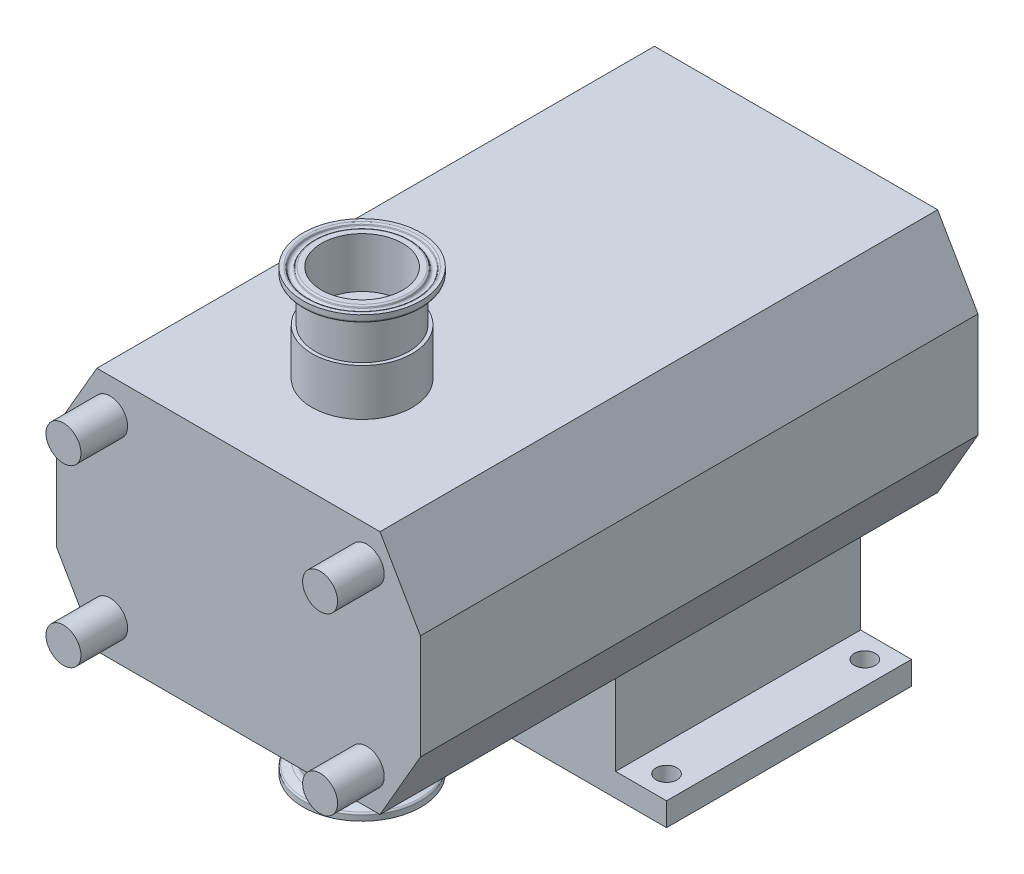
ISO-10303-21;
HEADER;
FILE_DESCRIPTION(('STEP AP214'),'2;1');
FILE_NAME('part.step','',(''),(''),'','','');
FILE_SCHEMA(('AUTOMOTIVE_DESIGN { 1 0 10303 214 1 1 1 1 }'));
ENDSEC;
DATA;
#1=APPLICATION_CONTEXT('core data for automotive mechanical design processes');
#2=APPLICATION_PROTOCOL_DEFINITION('international standard','automotive_design',2000,#1);
#3=PRODUCT_CONTEXT('',#1,'mechanical');
#4=PRODUCT('Part','Part','',(#3));
#5=PRODUCT_RELATED_PRODUCT_CATEGORY('part','',(#4));
#6=PRODUCT_DEFINITION_FORMATION('','',#4);
#7=PRODUCT_DEFINITION_CONTEXT('part definition',#1,'design');
#8=PRODUCT_DEFINITION('design','',#6,#7);
#9=PRODUCT_DEFINITION_SHAPE('','',#8);
#10=(LENGTH_UNIT() NAMED_UNIT(*) SI_UNIT(.MILLI.,.METRE.));
#11=(NAMED_UNIT(*) PLANE_ANGLE_UNIT() SI_UNIT($,.RADIAN.));
#12=(NAMED_UNIT(*) SI_UNIT($,.STERADIAN.) SOLID_ANGLE_UNIT());
#13=UNCERTAINTY_MEASURE_WITH_UNIT(LENGTH_MEASURE(1.E-05),#10,'distance_accuracy_value','');
#14=(GEOMETRIC_REPRESENTATION_CONTEXT(3) GLOBAL_UNCERTAINTY_ASSIGNED_CONTEXT((#13)) GLOBAL_UNIT_ASSIGNED_CONTEXT((#10,
#11,#12)) REPRESENTATION_CONTEXT('',''));
#15=CARTESIAN_POINT('',(0.,0.,0.));
#16=DIRECTION('',(0.,0.,1.));
#17=DIRECTION('',(1.,0.,0.));
#18=AXIS2_PLACEMENT_3D('',#15,#16,#17);
#19=CARTESIAN_POINT('',(-19.2960380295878,94.,172.148478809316));
#20=DIRECTION('',(0.,1.,0.));
#21=DIRECTION('',(-0.583149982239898,0.,0.81236451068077));
#22=AXIS2_PLACEMENT_3D('',#19,#20,#21);
#23=PLANE('',#22);
#24=CARTESIAN_POINT('',(0.,94.,186.));
#25=DIRECTION('',(0.,1.,0.));
#26=DIRECTION('',(-0.583149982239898,0.,0.81236451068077));
#27=AXIS2_PLACEMENT_3D('',#24,#25,#26);
#28=CIRCLE('',#27,25.25);
#29=CARTESIAN_POINT('',(-14.7245370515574,94.,206.512203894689));
#30=VERTEX_POINT('',#29);
#31=EDGE_CURVE('P0_E10',#30,#30,#28,.T.);
#32=ORIENTED_EDGE('',*,*,#31,.T.);
#33=EDGE_LOOP('',(#32));
#34=FACE_BOUND('',#33,.T.);
#35=CARTESIAN_POINT('',(0.,94.,186.));
#36=DIRECTION('',(0.,1.,0.));
#37=DIRECTION('',(-0.583149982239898,0.,0.81236451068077));
#38=AXIS2_PLACEMENT_3D('',#35,#36,#37);
#39=CIRCLE('',#38,23.7529308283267);
#40=CARTESIAN_POINT('',(-13.8515211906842,94.,205.296038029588));
#41=VERTEX_POINT('',#40);
#42=EDGE_CURVE('P0_E61',#41,#41,#39,.T.);
#43=ORIENTED_EDGE('',*,*,#42,.F.);
#44=EDGE_LOOP('',(#43));
#45=FACE_BOUND('',#44,.T.);
#46=ADVANCED_FACE('P0_F15',(#34,#45),#23,.T.);
#47=CARTESIAN_POINT('',(0.,101.,186.));
#48=DIRECTION('',(0.,1.,0.));
#49=DIRECTION('',(-0.583149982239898,0.,0.81236451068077));
#50=AXIS2_PLACEMENT_3D('',#47,#48,#49);
#51=CYLINDRICAL_SURFACE('',#50,25.25);
#52=CARTESIAN_POINT('',(0.,91.7101660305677,186.));
#53=DIRECTION('',(0.,1.,0.));
#54=DIRECTION('',(-0.583149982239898,0.,0.81236451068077));
#55=AXIS2_PLACEMENT_3D('',#52,#53,#54);
#56=CIRCLE('',#55,25.25);
#57=CARTESIAN_POINT('',(-14.7245370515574,91.7101660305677,206.512203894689));
#58=VERTEX_POINT('',#57);
#59=EDGE_CURVE('P0_E21',#58,#58,#56,.T.);
#60=ORIENTED_EDGE('',*,*,#59,.T.);
#61=EDGE_LOOP('',(#60));
#62=FACE_BOUND('',#61,.T.);
#63=ORIENTED_EDGE('',*,*,#31,.F.);
#64=EDGE_LOOP('',(#63));
#65=FACE_BOUND('',#64,.T.);
#66=ADVANCED_FACE('P0_F69',(#62,#65),#51,.T.);
#67=CARTESIAN_POINT('',(0.,91.7101660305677,186.));
#68=DIRECTION('',(0.,1.,0.));
#69=DIRECTION('',(-0.583149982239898,0.,0.81236451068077));
#70=AXIS2_PLACEMENT_3D('',#67,#68,#69);
#71=TOROIDAL_SURFACE('',#70,24.45,0.799999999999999);
#72=CARTESIAN_POINT('',(0.,90.958411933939,186.));
#73=DIRECTION('',(0.,1.,0.));
#74=DIRECTION('',(-0.583149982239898,0.,0.81236451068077));
#75=AXIS2_PLACEMENT_3D('',#72,#73,#74);
#76=CIRCLE('',#75,24.7236161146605);
#77=CARTESIAN_POINT('',(-14.4175762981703,90.958411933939,206.084588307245));
#78=VERTEX_POINT('',#77);
#79=EDGE_CURVE('P0_E25',#78,#78,#76,.T.);
#80=ORIENTED_EDGE('',*,*,#79,.T.);
#81=EDGE_LOOP('',(#80));
#82=FACE_BOUND('',#81,.T.);
#83=ORIENTED_EDGE('',*,*,#59,.F.);
#84=EDGE_LOOP('',(#83));
#85=FACE_BOUND('',#84,.T.);
#86=ADVANCED_FACE('P0_F74',(#82,#85),#71,.T.);
#87=CARTESIAN_POINT('',(0.,90.958411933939,186.));
#88=DIRECTION('',(0.,1.,0.));
#89=DIRECTION('',(-0.583149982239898,0.,0.81236451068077));
#90=AXIS2_PLACEMENT_3D('',#87,#88,#89);
#91=CONICAL_SURFACE('',#90,24.7236161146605,1.22173047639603);
#92=CARTESIAN_POINT('',(0.,89.7181264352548,186.));
#93=DIRECTION('',(0.,1.,0.));
#94=DIRECTION('',(-0.583149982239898,0.,0.81236451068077));
#95=AXIS2_PLACEMENT_3D('',#92,#93,#94);
#96=CIRCLE('',#95,21.3159597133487);
#97=CARTESIAN_POINT('',(-12.4304015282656,89.7181264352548,203.316329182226));
#98=VERTEX_POINT('',#97);
#99=EDGE_CURVE('P0_E29',#98,#98,#96,.T.);
#100=ORIENTED_EDGE('',*,*,#99,.T.);
#101=EDGE_LOOP('',(#100));
#102=FACE_BOUND('',#101,.T.);
#103=ORIENTED_EDGE('',*,*,#79,.F.);
#104=EDGE_LOOP('',(#103));
#105=FACE_BOUND('',#104,.T.);
#106=ADVANCED_FACE('P0_F78',(#102,#105),#91,.T.);
#107=CARTESIAN_POINT('',(0.,87.838741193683,186.));
#108=DIRECTION('',(0.,1.,0.));
#109=DIRECTION('',(-0.583149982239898,0.,0.81236451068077));
#110=AXIS2_PLACEMENT_3D('',#107,#108,#109);
#111=TOROIDAL_SURFACE('',#110,22.,2.);
#112=CARTESIAN_POINT('',(0.,87.838741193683,186.));
#113=DIRECTION('',(0.,1.,0.));
#114=DIRECTION('',(-0.583149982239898,0.,0.81236451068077));
#115=AXIS2_PLACEMENT_3D('',#112,#113,#114);
#116=CIRCLE('',#115,20.);
#117=CARTESIAN_POINT('',(-11.6629996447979,87.838741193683,202.247290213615));
#118=VERTEX_POINT('',#117);
#119=EDGE_CURVE('P0_E34',#118,#118,#116,.T.);
#120=ORIENTED_EDGE('',*,*,#119,.T.);
#121=EDGE_LOOP('',(#120));
#122=FACE_BOUND('',#121,.T.);
#123=ORIENTED_EDGE('',*,*,#99,.F.);
#124=EDGE_LOOP('',(#123));
#125=FACE_BOUND('',#124,.T.);
#126=ADVANCED_FACE('P0_F85',(#122,#125),#111,.F.);
#127=CARTESIAN_POINT('',(0.,101.,186.));
#128=DIRECTION('',(0.,1.,0.));
#129=DIRECTION('',(-0.583149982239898,0.,0.81236451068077));
#130=AXIS2_PLACEMENT_3D('',#127,#128,#129);
#131=CYLINDRICAL_SURFACE('',#130,20.);
#132=CARTESIAN_POINT('',(0.,72.5,186.));
#133=DIRECTION('',(0.,1.,0.));
#134=DIRECTION('',(-0.583149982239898,0.,0.81236451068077));
#135=AXIS2_PLACEMENT_3D('',#132,#133,#134);
#136=CIRCLE('',#135,20.);
#137=CARTESIAN_POINT('',(-11.6629996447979,72.5,202.247290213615));
#138=VERTEX_POINT('',#137);
#139=EDGE_CURVE('P0_E37',#138,#138,#136,.T.);
#140=ORIENTED_EDGE('',*,*,#139,.T.);
#141=EDGE_LOOP('',(#140));
#142=FACE_BOUND('',#141,.T.);
#143=ORIENTED_EDGE('',*,*,#119,.F.);
#144=EDGE_LOOP('',(#143));
#145=FACE_BOUND('',#144,.T.);
#146=ADVANCED_FACE('P0_F89',(#142,#145),#131,.T.);
#147=CARTESIAN_POINT('',(-14.1351424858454,72.5,175.853190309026));
#148=DIRECTION('',(0.,-1.,0.));
#149=DIRECTION('',(0.583149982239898,0.,-0.81236451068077));
#150=AXIS2_PLACEMENT_3D('',#147,#148,#149);
#151=PLANE('',#150);
#152=CARTESIAN_POINT('',(0.,72.5,186.));
#153=DIRECTION('',(0.,1.,0.));
#154=DIRECTION('',(-0.583149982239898,0.,0.81236451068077));
#155=AXIS2_PLACEMENT_3D('',#152,#153,#154);
#156=CIRCLE('',#155,17.4);
#157=CARTESIAN_POINT('',(-10.1468096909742,72.5,200.135142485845));
#158=VERTEX_POINT('',#157);
#159=EDGE_CURVE('P0_E40',#158,#158,#156,.T.);
#160=ORIENTED_EDGE('',*,*,#159,.T.);
#161=EDGE_LOOP('',(#160));
#162=FACE_BOUND('',#161,.T.);
#163=ORIENTED_EDGE('',*,*,#139,.F.);
#164=EDGE_LOOP('',(#163));
#165=FACE_BOUND('',#164,.T.);
#166=ADVANCED_FACE('P0_F93',(#162,#165),#151,.T.);
#167=CARTESIAN_POINT('',(0.,101.,186.));
#168=DIRECTION('',(0.,1.,0.));
#169=DIRECTION('',(-0.583149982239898,0.,0.81236451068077));
#170=AXIS2_PLACEMENT_3D('',#167,#168,#169);
#171=CYLINDRICAL_SURFACE('',#170,17.4);
#172=CARTESIAN_POINT('',(0.,94.,186.));
#173=DIRECTION('',(0.,1.,0.));
#174=DIRECTION('',(-0.583149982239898,0.,0.81236451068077));
#175=AXIS2_PLACEMENT_3D('',#172,#173,#174);
#176=CIRCLE('',#175,17.4);
#177=CARTESIAN_POINT('',(-10.1468096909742,94.,200.135142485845));
#178=VERTEX_POINT('',#177);
#179=EDGE_CURVE('P0_E43',#178,#178,#176,.T.);
#180=ORIENTED_EDGE('',*,*,#179,.T.);
#181=EDGE_LOOP('',(#180));
#182=FACE_BOUND('',#181,.T.);
#183=ORIENTED_EDGE('',*,*,#159,.F.);
#184=EDGE_LOOP('',(#183));
#185=FACE_BOUND('',#184,.T.);
#186=ADVANCED_FACE('P0_F97',(#182,#185),#171,.F.);
#187=CARTESIAN_POINT('',(-14.1351424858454,94.,175.853190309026));
#188=DIRECTION('',(0.,1.,0.));
#189=DIRECTION('',(-0.583149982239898,0.,0.81236451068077));
#190=AXIS2_PLACEMENT_3D('',#187,#188,#189);
#191=PLANE('',#190);
#192=CARTESIAN_POINT('',(0.,94.,186.));
#193=DIRECTION('',(0.,1.,0.));
#194=DIRECTION('',(-0.583149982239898,0.,0.81236451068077));
#195=AXIS2_PLACEMENT_3D('',#192,#193,#194);
#196=CIRCLE('',#195,19.7470691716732);
#197=CARTESIAN_POINT('',(-11.5155030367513,94.,202.041818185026));
#198=VERTEX_POINT('',#197);
#199=EDGE_CURVE('P0_E46',#198,#198,#196,.T.);
#200=ORIENTED_EDGE('',*,*,#199,.T.);
#201=EDGE_LOOP('',(#200));
#202=FACE_BOUND('',#201,.T.);
#203=ORIENTED_EDGE('',*,*,#179,.F.);
#204=EDGE_LOOP('',(#203));
#205=FACE_BOUND('',#204,.T.);
#206=ADVANCED_FACE('P0_F101',(#202,#205),#191,.T.);
#207=CARTESIAN_POINT('',(0.,93.2,186.));
#208=DIRECTION('',(0.,1.,0.));
#209=DIRECTION('',(-0.583149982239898,0.,0.81236451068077));
#210=AXIS2_PLACEMENT_3D('',#207,#208,#209);
#211=TOROIDAL_SURFACE('',#210,19.7470691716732,0.800000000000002);
#212=CARTESIAN_POINT('',(0.,93.5125849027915,186.));
#213=DIRECTION('',(0.,1.,0.));
#214=DIRECTION('',(-0.583149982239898,0.,0.81236451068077));
#215=AXIS2_PLACEMENT_3D('',#212,#213,#214);
#216=CIRCLE('',#215,20.4834730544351);
#217=CARTESIAN_POINT('',(-11.9449369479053,93.5125849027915,202.640046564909));
#218=VERTEX_POINT('',#217);
#219=EDGE_CURVE('P0_E49',#218,#218,#216,.T.);
#220=ORIENTED_EDGE('',*,*,#219,.T.);
#221=EDGE_LOOP('',(#220));
#222=FACE_BOUND('',#221,.T.);
#223=ORIENTED_EDGE('',*,*,#199,.F.);
#224=EDGE_LOOP('',(#223));
#225=FACE_BOUND('',#224,.T.);
#226=ADVANCED_FACE('P0_F105',(#222,#225),#211,.T.);
#227=CARTESIAN_POINT('',(0.,93.5125849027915,186.));
#228=DIRECTION('',(0.,-1.,0.));
#229=DIRECTION('',(0.583149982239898,0.,-0.81236451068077));
#230=AXIS2_PLACEMENT_3D('',#227,#228,#229);
#231=CONICAL_SURFACE('',#230,20.4834730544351,0.401425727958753);
#232=CARTESIAN_POINT('',(0.,93.1311226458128,186.));
#233=DIRECTION('',(0.,1.,0.));
#234=DIRECTION('',(-0.583149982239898,0.,0.81236451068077));
#235=AXIS2_PLACEMENT_3D('',#232,#233,#234);
#236=CIRCLE('',#235,20.6453941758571);
#237=CARTESIAN_POINT('',(-12.0393612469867,93.1311226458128,202.771585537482));
#238=VERTEX_POINT('',#237);
#239=EDGE_CURVE('P0_E52',#238,#238,#236,.T.);
#240=ORIENTED_EDGE('',*,*,#239,.T.);
#241=EDGE_LOOP('',(#240));
#242=FACE_BOUND('',#241,.T.);
#243=ORIENTED_EDGE('',*,*,#219,.F.);
#244=EDGE_LOOP('',(#243));
#245=FACE_BOUND('',#244,.T.);
#246=ADVANCED_FACE('P0_F109',(#242,#245),#231,.T.);
#247=CARTESIAN_POINT('',(0.,93.6,186.));
#248=DIRECTION('',(0.,1.,0.));
#249=DIRECTION('',(-0.583149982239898,0.,0.81236451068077));
#250=AXIS2_PLACEMENT_3D('',#247,#248,#249);
#251=TOROIDAL_SURFACE('',#250,21.75,1.2);
#252=CARTESIAN_POINT('',(0.,93.1311226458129,186.));
#253=DIRECTION('',(0.,1.,0.));
#254=DIRECTION('',(-0.583149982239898,0.,0.81236451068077));
#255=AXIS2_PLACEMENT_3D('',#252,#253,#254);
#256=CIRCLE('',#255,22.854605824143);
#257=CARTESIAN_POINT('',(-13.3276629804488,93.1311226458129,204.566270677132));
#258=VERTEX_POINT('',#257);
#259=EDGE_CURVE('P0_E55',#258,#258,#256,.T.);
#260=ORIENTED_EDGE('',*,*,#259,.T.);
#261=EDGE_LOOP('',(#260));
#262=FACE_BOUND('',#261,.T.);
#263=ORIENTED_EDGE('',*,*,#239,.F.);
#264=EDGE_LOOP('',(#263));
#265=FACE_BOUND('',#264,.T.);
#266=ADVANCED_FACE('P0_F113',(#262,#265),#251,.F.);
#267=CARTESIAN_POINT('',(0.,93.1311226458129,186.));
#268=DIRECTION('',(0.,1.,0.));
#269=DIRECTION('',(-0.583149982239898,0.,0.81236451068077));
#270=AXIS2_PLACEMENT_3D('',#267,#268,#269);
#271=CONICAL_SURFACE('',#270,22.854605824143,0.401425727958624);
#272=CARTESIAN_POINT('',(0.,93.5125849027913,186.));
#273=DIRECTION('',(0.,1.,0.));
#274=DIRECTION('',(-0.583149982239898,0.,0.81236451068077));
#275=AXIS2_PLACEMENT_3D('',#272,#273,#274);
#276=CIRCLE('',#275,23.0165269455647);
#277=CARTESIAN_POINT('',(-13.4220872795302,93.5125849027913,204.697809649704));
#278=VERTEX_POINT('',#277);
#279=EDGE_CURVE('P0_E58',#278,#278,#276,.T.);
#280=ORIENTED_EDGE('',*,*,#279,.T.);
#281=EDGE_LOOP('',(#280));
#282=FACE_BOUND('',#281,.T.);
#283=ORIENTED_EDGE('',*,*,#259,.F.);
#284=EDGE_LOOP('',(#283));
#285=FACE_BOUND('',#284,.T.);
#286=ADVANCED_FACE('P0_F117',(#282,#285),#271,.F.);
#287=CARTESIAN_POINT('',(0.,93.2,186.));
#288=DIRECTION('',(0.,1.,0.));
#289=DIRECTION('',(-0.583149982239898,0.,0.81236451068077));
#290=AXIS2_PLACEMENT_3D('',#287,#288,#289);
#291=TOROIDAL_SURFACE('',#290,23.7529308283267,0.8);
#292=ORIENTED_EDGE('',*,*,#42,.T.);
#293=EDGE_LOOP('',(#292));
#294=FACE_BOUND('',#293,.T.);
#295=ORIENTED_EDGE('',*,*,#279,.F.);
#296=EDGE_LOOP('',(#295));
#297=FACE_BOUND('',#296,.T.);
#298=ADVANCED_FACE('P0_F65',(#294,#297),#291,.T.);
#299=CLOSED_SHELL('',(#46,#66,#86,#106,#126,#146,#166,#186,#206,#226,#246,#266,#286,#298));
#300=MANIFOLD_SOLID_BREP('P0_B1',#299);
#301=CARTESIAN_POINT('',(-25.,0.,241.732657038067));
#302=DIRECTION('',(0.,0.,1.));
#303=DIRECTION('',(1.,0.,0.));
#304=AXIS2_PLACEMENT_3D('',#301,#302,#303);
#305=CYLINDRICAL_SURFACE('',#304,9.5);
#306=CARTESIAN_POINT('',(-25.,0.,-2.));
#307=DIRECTION('',(0.,0.,1.));
#308=DIRECTION('',(1.,0.,0.));
#309=AXIS2_PLACEMENT_3D('',#306,#307,#308);
#310=CIRCLE('',#309,9.5);
#311=CARTESIAN_POINT('',(-15.5,0.,-2.));
#312=VERTEX_POINT('',#311);
#313=EDGE_CURVE('P1_E277',#312,#312,#310,.T.);
#314=ORIENTED_EDGE('',*,*,#313,.F.);
#315=EDGE_LOOP('',(#314));
#316=FACE_BOUND('',#315,.T.);
#317=DIRECTION('',(0.,0.,1.));
#318=VECTOR('',#317,1.);
#319=CARTESIAN_POINT('',(-15.98612181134,2.99999999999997,241.732657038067));
#320=LINE('',#319,#318);
#321=CARTESIAN_POINT('',(-15.98612181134,3.,-42.));
#322=VERTEX_POINT('',#321);
#323=CARTESIAN_POINT('',(-15.98612181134,3.,-22.));
#324=VERTEX_POINT('',#323);
#325=EDGE_CURVE('P1_E178',#322,#324,#320,.T.);
#326=ORIENTED_EDGE('',*,*,#325,.F.);
#327=CARTESIAN_POINT('',(-25.,0.,-42.));
#328=DIRECTION('',(0.,0.,1.));
#329=DIRECTION('',(1.,0.,0.));
#330=AXIS2_PLACEMENT_3D('',#327,#328,#329);
#331=CIRCLE('',#330,9.5);
#332=CARTESIAN_POINT('',(-15.98612181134,-3.,-42.));
#333=VERTEX_POINT('',#332);
#334=EDGE_CURVE('P1_E176',#322,#333,#331,.T.);
#335=ORIENTED_EDGE('',*,*,#334,.T.);
#336=DIRECTION('',(0.,0.,1.));
#337=VECTOR('',#336,1.);
#338=CARTESIAN_POINT('',(-15.98612181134,-3.00000000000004,241.732657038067));
#339=LINE('',#338,#337);
#340=CARTESIAN_POINT('',(-15.98612181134,-3.00000000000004,-22.));
#341=VERTEX_POINT('',#340);
#342=EDGE_CURVE('P1_E39',#341,#333,#339,.F.);
#343=ORIENTED_EDGE('',*,*,#342,.F.);
#344=CARTESIAN_POINT('',(-15.5,0.,-25.));
#345=CARTESIAN_POINT('',(-15.5000006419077,0.16416708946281,-24.9999991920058));
#346=CARTESIAN_POINT('',(-15.5042954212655,0.328342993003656,-24.9864802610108));
#347=CARTESIAN_POINT('',(-15.5210070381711,0.651888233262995,-24.9329071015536));
#348=CARTESIAN_POINT('',(-15.5334255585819,0.811256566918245,-24.8928473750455));
#349=CARTESIAN_POINT('',(-15.5650291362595,1.12047453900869,-24.787682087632));
#350=CARTESIAN_POINT('',(-15.5842035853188,1.2703386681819,-24.7226157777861));
#351=CARTESIAN_POINT('',(-15.6273427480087,1.55702915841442,-24.5694529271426));
#352=CARTESIAN_POINT('',(-15.6513082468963,1.69385337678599,-24.4813526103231));
#353=CARTESIAN_POINT('',(-15.7023324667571,1.95488615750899,-24.2817053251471));
#354=CARTESIAN_POINT('',(-15.7294596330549,2.07862693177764,-24.1695643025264));
#355=CARTESIAN_POINT('',(-15.7833564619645,2.30589485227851,-23.9262834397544));
#356=CARTESIAN_POINT('',(-15.8101260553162,2.4094181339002,-23.7951399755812));
#357=CARTESIAN_POINT('',(-15.8610140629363,2.59586933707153,-23.5135024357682));
#358=CARTESIAN_POINT('',(-15.8850481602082,2.67820924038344,-23.3626023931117));
#359=CARTESIAN_POINT('',(-15.9267127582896,2.81614778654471,-23.0482150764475));
#360=CARTESIAN_POINT('',(-15.9443449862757,2.87175364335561,-22.8847312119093));
#361=CARTESIAN_POINT('',(-15.9704927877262,2.95292728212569,-22.5551021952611));
#362=CARTESIAN_POINT('',(-15.979271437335,2.97936420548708,-22.3891925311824));
#363=CARTESIAN_POINT('',(-15.9874987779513,3.00416514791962,-22.0550782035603));
#364=CARTESIAN_POINT('',(-15.9869500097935,3.00253681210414,-21.8868741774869));
#365=CARTESIAN_POINT('',(-15.9768164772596,2.97193247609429,-21.5601689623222));
#366=CARTESIAN_POINT('',(-15.9675982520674,2.94406576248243,-21.4015505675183));
#367=CARTESIAN_POINT('',(-15.9417605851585,2.86357596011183,-21.0913669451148));
#368=CARTESIAN_POINT('',(-15.9251403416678,2.81095018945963,-20.9398024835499));
#369=CARTESIAN_POINT('',(-15.8860934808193,2.68166168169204,-20.6454054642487));
#370=CARTESIAN_POINT('',(-15.8635843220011,2.60465367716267,-20.5027359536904));
#371=CARTESIAN_POINT('',(-15.8153331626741,2.4290264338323,-20.2319823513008));
#372=CARTESIAN_POINT('',(-15.7895903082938,2.33040148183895,-20.103902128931));
#373=CARTESIAN_POINT('',(-15.7363062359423,2.10891443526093,-19.859697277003));
#374=CARTESIAN_POINT('',(-15.7087370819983,1.98513792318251,-19.7444065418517));
#375=CARTESIAN_POINT('',(-15.6559621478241,1.71966506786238,-19.5360135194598));
#376=CARTESIAN_POINT('',(-15.6307565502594,1.57796734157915,-19.4429129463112));
#377=CARTESIAN_POINT('',(-15.5852743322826,1.27904248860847,-19.2809619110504));
#378=CARTESIAN_POINT('',(-15.5650393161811,1.12169880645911,-19.2123141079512));
#379=CARTESIAN_POINT('',(-15.5320787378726,0.796908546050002,-19.102710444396));
#380=CARTESIAN_POINT('',(-15.5193508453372,0.629465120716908,-19.0617459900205));
#381=CARTESIAN_POINT('',(-15.5032152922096,0.296303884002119,-19.0101010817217));
#382=CARTESIAN_POINT('',(-15.4994604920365,0.130777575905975,-18.9982920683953));
#383=CARTESIAN_POINT('',(-15.5006652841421,-0.199911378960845,-19.0021062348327));
#384=CARTESIAN_POINT('',(-15.5056235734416,-0.365074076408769,-19.017725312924));
#385=CARTESIAN_POINT('',(-15.5234691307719,-0.685969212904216,-19.0750481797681));
#386=CARTESIAN_POINT('',(-15.5361511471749,-0.841834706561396,-19.1160771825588));
#387=CARTESIAN_POINT('',(-15.5679556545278,-1.14442314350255,-19.2222287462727));
#388=CARTESIAN_POINT('',(-15.5870789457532,-1.2911449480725,-19.2873543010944));
#389=CARTESIAN_POINT('',(-15.6303910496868,-1.57531276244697,-19.4416461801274));
#390=CARTESIAN_POINT('',(-15.6546933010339,-1.71244019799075,-19.5313665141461));
#391=CARTESIAN_POINT('',(-15.7055878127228,-1.97006979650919,-19.7316386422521));
#392=CARTESIAN_POINT('',(-15.7321807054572,-2.09056734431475,-19.8421961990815));
#393=CARTESIAN_POINT('',(-15.7860170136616,-2.31658675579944,-20.0863131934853));
#394=CARTESIAN_POINT('',(-15.813243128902,-2.42130400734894,-20.2206231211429));
#395=CARTESIAN_POINT('',(-15.8641405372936,-2.60679013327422,-20.5055000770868));
#396=CARTESIAN_POINT('',(-15.8878118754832,-2.68755931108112,-20.6560668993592));
#397=CARTESIAN_POINT('',(-15.9286607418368,-2.82237097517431,-20.9689238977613));
#398=CARTESIAN_POINT('',(-15.9458617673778,-2.87651039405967,-21.1311690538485));
#399=CARTESIAN_POINT('',(-15.9716606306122,-2.95649944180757,-21.4631296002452));
#400=CARTESIAN_POINT('',(-15.9802618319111,-2.9823601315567,-21.6328420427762));
#401=CARTESIAN_POINT('',(-15.9875316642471,-3.0042524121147,-21.9664938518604));
#402=CARTESIAN_POINT('',(-15.9866406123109,-3.00160628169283,-22.1303379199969));
#403=CARTESIAN_POINT('',(-15.9760989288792,-2.96976166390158,-22.4551233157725));
#404=CARTESIAN_POINT('',(-15.9664487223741,-2.94056446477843,-22.6160647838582));
#405=CARTESIAN_POINT('',(-15.9397869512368,-2.8573397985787,-22.928056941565));
#406=CARTESIAN_POINT('',(-15.9228900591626,-2.80369834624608,-23.0792211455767));
#407=CARTESIAN_POINT('',(-15.8836701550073,-2.67341300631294,-23.3705239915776));
#408=CARTESIAN_POINT('',(-15.8613460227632,-2.59676436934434,-23.5106603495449));
#409=CARTESIAN_POINT('',(-15.8126776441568,-2.4190708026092,-23.781973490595));
#410=CARTESIAN_POINT('',(-15.7862086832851,-2.31717569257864,-23.9125710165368));
#411=CARTESIAN_POINT('',(-15.7327983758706,-2.0933684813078,-24.1552416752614));
#412=CARTESIAN_POINT('',(-15.705856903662,-1.97145098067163,-24.2673097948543));
#413=CARTESIAN_POINT('',(-15.6534511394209,-1.7061326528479,-24.4735138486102));
#414=CARTESIAN_POINT('',(-15.6280668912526,-1.56214764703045,-24.5669207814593));
#415=CARTESIAN_POINT('',(-15.5826524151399,-1.25971894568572,-24.728083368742));
#416=CARTESIAN_POINT('',(-15.5626201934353,-1.10128066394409,-24.7958485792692));
#417=CARTESIAN_POINT('',(-15.531467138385,-0.787271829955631,-24.8991975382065));
#418=CARTESIAN_POINT('',(-15.5197707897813,-0.632450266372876,-24.9368877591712));
#419=CARTESIAN_POINT('',(-15.5040377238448,-0.318421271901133,-24.9872867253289));
#420=CARTESIAN_POINT('',(-15.4999993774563,-0.15921478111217,-25.00000078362));
#421=CARTESIAN_POINT('',(-15.5,0.,-25.));
#422=B_SPLINE_CURVE_WITH_KNOTS('',3,(#344,#345,#346,#347,#348,#349,#350,#351,#352,#353,#354,
#355,#356,#357,#358,#359,#360,#361,#362,#363,#364,#365,#366,#367,#368,#369,#370,#371,#372,#373,
#374,#375,#376,#377,#378,#379,#380,#381,#382,#383,#384,#385,#386,#387,#388,#389,#390,#391,#392,
#393,#394,#395,#396,#397,#398,#399,#400,#401,#402,#403,#404,#405,#406,#407,#408,#409,#410,#411,
#412,#413,#414,#415,#416,#417,#418,#419,#420,#421),.UNSPECIFIED.,.T.,.F.,(4,2,2,2,2,2,2,2,2,2,2,
2,2,2,2,2,2,2,2,2,2,2,2,2,2,2,2,2,2,2,2,2,2,2,2,2,2,2,4),(0.,0.49191594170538,0.983933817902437,
1.47518254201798,1.96651184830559,2.47177433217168,2.97713330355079,3.49529138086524,
4.0133095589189,4.51543663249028,5.01742692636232,5.49910423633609,5.98083373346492,
6.46971527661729,6.95872618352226,7.47049694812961,7.98230723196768,8.49826565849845,
9.01406383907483,9.50955937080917,10.0049808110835,10.487778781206,10.9706367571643,
11.4654198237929,11.9603399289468,12.4753133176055,12.9902801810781,13.5033584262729,
14.0162359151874,14.5054301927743,14.9946007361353,15.4763007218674,15.9581002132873,
16.4590917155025,16.9602185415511,17.4781824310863,17.9959530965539,18.4731312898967,
18.9502079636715),.UNSPECIFIED.);
#423=EDGE_CURVE('P1_E11',#324,#341,#422,.T.);
#424=ORIENTED_EDGE('',*,*,#423,.F.);
#425=EDGE_LOOP('',(#326,#335,#343,#424));
#426=FACE_BOUND('',#425,.T.);
#427=ADVANCED_FACE('P1_F17',(#316,#426),#305,.T.);
#428=CARTESIAN_POINT('',(-60.6794919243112,-52.5,239.));
#429=DIRECTION('',(0.,1.,0.));
#430=DIRECTION('',(-1.,0.,0.));
#431=AXIS2_PLACEMENT_3D('',#428,#429,#430);
#432=PLANE('',#431);
#433=CARTESIAN_POINT('',(0.,-52.5,186.));
#434=DIRECTION('',(0.,1.,0.));
#435=DIRECTION('',(-1.,0.,0.));
#436=AXIS2_PLACEMENT_3D('',#433,#434,#435);
#437=CIRCLE('',#436,21.5);
#438=CARTESIAN_POINT('',(-21.5,-52.5,186.));
#439=VERTEX_POINT('',#438);
#440=EDGE_CURVE('P1_E192',#439,#439,#437,.T.);
#441=ORIENTED_EDGE('',*,*,#440,.T.);
#442=EDGE_LOOP('',(#441));
#443=FACE_BOUND('',#442,.T.);
#444=DIRECTION('',(1.,0.,0.));
#445=VECTOR('',#444,1.);
#446=CARTESIAN_POINT('',(-60.6794919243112,-52.5,0.));
#447=LINE('',#446,#445);
#448=CARTESIAN_POINT('',(-60.6794919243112,-52.5,0.));
#449=VERTEX_POINT('',#448);
#450=CARTESIAN_POINT('',(60.6794919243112,-52.5,0.));
#451=VERTEX_POINT('',#450);
#452=EDGE_CURVE('P1_E337',#449,#451,#447,.T.);
#453=ORIENTED_EDGE('',*,*,#452,.T.);
#454=DIRECTION('',(0.,0.,-1.));
#455=VECTOR('',#454,1.);
#456=CARTESIAN_POINT('',(60.6794919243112,-52.5,239.));
#457=LINE('',#456,#455);
#458=CARTESIAN_POINT('',(60.6794919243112,-52.5,239.));
#459=VERTEX_POINT('',#458);
#460=EDGE_CURVE('P1_E347',#459,#451,#457,.T.);
#461=ORIENTED_EDGE('',*,*,#460,.F.);
#462=DIRECTION('',(1.,0.,0.));
#463=VECTOR('',#462,1.);
#464=CARTESIAN_POINT('',(-60.6794919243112,-52.5,239.));
#465=LINE('',#464,#463);
#466=CARTESIAN_POINT('',(-60.6794919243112,-52.5,239.));
#467=VERTEX_POINT('',#466);
#468=EDGE_CURVE('P1_E320',#467,#459,#465,.T.);
#469=ORIENTED_EDGE('',*,*,#468,.F.);
#470=DIRECTION('',(0.,0.,-1.));
#471=VECTOR('',#470,1.);
#472=CARTESIAN_POINT('',(-60.6794919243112,-52.5,239.));
#473=LINE('',#472,#471);
#474=EDGE_CURVE('P1_E350',#467,#449,#473,.T.);
#475=ORIENTED_EDGE('',*,*,#474,.T.);
#476=EDGE_LOOP('',(#453,#461,#469,#475));
#477=FACE_BOUND('',#476,.T.);
#478=DIRECTION('',(1.,0.,0.));
#479=VECTOR('',#478,1.);
#480=CARTESIAN_POINT('',(45.6794919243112,-52.5,18.));
#481=LINE('',#480,#479);
#482=CARTESIAN_POINT('',(-45.6794919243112,-52.5,18.));
#483=VERTEX_POINT('',#482);
#484=CARTESIAN_POINT('',(45.6794919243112,-52.5,18.));
#485=VERTEX_POINT('',#484);
#486=EDGE_CURVE('P1_E220',#483,#485,#481,.T.);
#487=ORIENTED_EDGE('',*,*,#486,.F.);
#488=DIRECTION('',(0.,0.,1.));
#489=VECTOR('',#488,1.);
#490=CARTESIAN_POINT('',(-45.6794919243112,-52.5,18.));
#491=LINE('',#490,#489);
#492=CARTESIAN_POINT('',(-45.6794919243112,-52.5,123.));
#493=VERTEX_POINT('',#492);
#494=EDGE_CURVE('P1_E238',#483,#493,#491,.T.);
#495=ORIENTED_EDGE('',*,*,#494,.T.);
#496=DIRECTION('',(1.,0.,0.));
#497=VECTOR('',#496,1.);
#498=CARTESIAN_POINT('',(45.6794919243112,-52.5,123.));
#499=LINE('',#498,#497);
#500=CARTESIAN_POINT('',(45.6794919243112,-52.5,123.));
#501=VERTEX_POINT('',#500);
#502=EDGE_CURVE('P1_E219',#493,#501,#499,.T.);
#503=ORIENTED_EDGE('',*,*,#502,.T.);
#504=DIRECTION('',(0.,0.,1.));
#505=VECTOR('',#504,1.);
#506=CARTESIAN_POINT('',(45.6794919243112,-52.5,18.));
#507=LINE('',#506,#505);
#508=EDGE_CURVE('P1_E274',#485,#501,#507,.T.);
#509=ORIENTED_EDGE('',*,*,#508,.F.);
#510=EDGE_LOOP('',(#487,#495,#503,#509));
#511=FACE_BOUND('',#510,.T.);
#512=ADVANCED_FACE('P1_F393',(#443,#477,#511),#432,.F.);
#513=CARTESIAN_POINT('',(90.9903810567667,0.,0.));
#514=DIRECTION('',(0.,0.,1.));
#515=DIRECTION('',(1.,0.,0.));
#516=AXIS2_PLACEMENT_3D('',#513,#514,#515);
#517=PLANE('',#516);
#518=DIRECTION('',(-0.500000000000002,0.866025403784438,0.));
#519=VECTOR('',#518,1.);
#520=CARTESIAN_POINT('',(60.6794919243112,52.5,0.));
#521=LINE('',#520,#519);
#522=CARTESIAN_POINT('',(78.,22.5,0.));
#523=VERTEX_POINT('',#522);
#524=CARTESIAN_POINT('',(60.6794919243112,52.5,0.));
#525=VERTEX_POINT('',#524);
#526=EDGE_CURVE('P1_E305',#523,#525,#521,.T.);
#527=ORIENTED_EDGE('',*,*,#526,.F.);
#528=DIRECTION('',(0.,1.,0.));
#529=VECTOR('',#528,1.);
#530=CARTESIAN_POINT('',(78.,22.5,0.));
#531=LINE('',#530,#529);
#532=CARTESIAN_POINT('',(78.,-22.5,0.));
#533=VERTEX_POINT('',#532);
#534=EDGE_CURVE('P1_E312',#533,#523,#531,.T.);
#535=ORIENTED_EDGE('',*,*,#534,.F.);
#536=DIRECTION('',(0.500000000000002,0.866025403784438,0.));
#537=VECTOR('',#536,1.);
#538=CARTESIAN_POINT('',(60.6794919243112,-52.5,0.));
#539=LINE('',#538,#537);
#540=EDGE_CURVE('P1_E339',#451,#533,#539,.T.);
#541=ORIENTED_EDGE('',*,*,#540,.F.);
#542=ORIENTED_EDGE('',*,*,#452,.F.);
#543=DIRECTION('',(0.500000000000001,-0.866025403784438,0.));
#544=VECTOR('',#543,1.);
#545=CARTESIAN_POINT('',(-60.6794919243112,-52.5,0.));
#546=LINE('',#545,#544);
#547=CARTESIAN_POINT('',(-78.,-22.5,0.));
#548=VERTEX_POINT('',#547);
#549=EDGE_CURVE('P1_E335',#548,#449,#546,.T.);
#550=ORIENTED_EDGE('',*,*,#549,.F.);
#551=DIRECTION('',(0.,-1.,0.));
#552=VECTOR('',#551,1.);
#553=CARTESIAN_POINT('',(-78.,22.5,0.));
#554=LINE('',#553,#552);
#555=CARTESIAN_POINT('',(-78.,22.5,0.));
#556=VERTEX_POINT('',#555);
#557=EDGE_CURVE('P1_E333',#556,#548,#554,.T.);
#558=ORIENTED_EDGE('',*,*,#557,.F.);
#559=DIRECTION('',(-0.500000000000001,-0.866025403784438,0.));
#560=VECTOR('',#559,1.);
#561=CARTESIAN_POINT('',(-60.6794919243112,52.5,0.));
#562=LINE('',#561,#560);
#563=CARTESIAN_POINT('',(-60.6794919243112,52.5,0.));
#564=VERTEX_POINT('',#563);
#565=EDGE_CURVE('P1_E331',#564,#556,#562,.T.);
#566=ORIENTED_EDGE('',*,*,#565,.F.);
#567=DIRECTION('',(-1.,0.,0.));
#568=VECTOR('',#567,1.);
#569=CARTESIAN_POINT('',(-60.6794919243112,52.5,0.));
#570=LINE('',#569,#568);
#571=EDGE_CURVE('P1_E329',#525,#564,#570,.T.);
#572=ORIENTED_EDGE('',*,*,#571,.F.);
#573=EDGE_LOOP('',(#527,#535,#541,#542,#550,#558,#566,#572));
#574=FACE_BOUND('',#573,.T.);
#575=CARTESIAN_POINT('',(-25.,0.,0.));
#576=DIRECTION('',(0.,0.,1.));
#577=DIRECTION('',(1.,0.,0.));
#578=AXIS2_PLACEMENT_3D('',#575,#576,#577);
#579=CIRCLE('',#578,12.5);
#580=CARTESIAN_POINT('',(-12.5,0.,0.));
#581=VERTEX_POINT('',#580);
#582=EDGE_CURVE('P1_E29',#581,#581,#579,.F.);
#583=ORIENTED_EDGE('',*,*,#582,.F.);
#584=EDGE_LOOP('',(#583));
#585=FACE_BOUND('',#584,.T.);
#586=ADVANCED_FACE('P1_F399',(#574,#585),#517,.F.);
#587=CARTESIAN_POINT('',(90.9903810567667,0.,239.));
#588=DIRECTION('',(0.,0.,1.));
#589=DIRECTION('',(1.,0.,0.));
#590=AXIS2_PLACEMENT_3D('',#587,#588,#589);
#591=PLANE('',#590);
#592=CARTESIAN_POINT('',(55.,-37.5,239.));
#593=DIRECTION('',(0.,0.,1.));
#594=DIRECTION('',(1.,0.,0.));
#595=AXIS2_PLACEMENT_3D('',#592,#593,#594);
#596=CIRCLE('',#595,7.49999999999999);
#597=CARTESIAN_POINT('',(62.5,-37.5,239.));
#598=VERTEX_POINT('',#597);
#599=EDGE_CURVE('P1_E287',#598,#598,#596,.T.);
#600=ORIENTED_EDGE('',*,*,#599,.F.);
#601=EDGE_LOOP('',(#600));
#602=FACE_BOUND('',#601,.T.);
#603=CARTESIAN_POINT('',(-55.,37.5,239.));
#604=DIRECTION('',(0.,0.,1.));
#605=DIRECTION('',(1.,0.,0.));
#606=AXIS2_PLACEMENT_3D('',#603,#604,#605);
#607=CIRCLE('',#606,7.5);
#608=CARTESIAN_POINT('',(-47.5,37.5,239.));
#609=VERTEX_POINT('',#608);
#610=EDGE_CURVE('P1_E299',#609,#609,#607,.T.);
#611=ORIENTED_EDGE('',*,*,#610,.F.);
#612=EDGE_LOOP('',(#611));
#613=FACE_BOUND('',#612,.T.);
#614=DIRECTION('',(-0.500000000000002,0.866025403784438,0.));
#615=VECTOR('',#614,1.);
#616=CARTESIAN_POINT('',(60.6794919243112,52.5,239.));
#617=LINE('',#616,#615);
#618=CARTESIAN_POINT('',(78.,22.5,239.));
#619=VERTEX_POINT('',#618);
#620=CARTESIAN_POINT('',(60.6794919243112,52.5,239.));
#621=VERTEX_POINT('',#620);
#622=EDGE_CURVE('P1_E308',#619,#621,#617,.T.);
#623=ORIENTED_EDGE('',*,*,#622,.T.);
#624=DIRECTION('',(-1.,0.,0.));
#625=VECTOR('',#624,1.);
#626=CARTESIAN_POINT('',(-60.6794919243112,52.5,239.));
#627=LINE('',#626,#625);
#628=CARTESIAN_POINT('',(-60.6794919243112,52.5,239.));
#629=VERTEX_POINT('',#628);
#630=EDGE_CURVE('P1_E311',#621,#629,#627,.T.);
#631=ORIENTED_EDGE('',*,*,#630,.T.);
#632=DIRECTION('',(-0.500000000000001,-0.866025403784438,0.));
#633=VECTOR('',#632,1.);
#634=CARTESIAN_POINT('',(-60.6794919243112,52.5,239.));
#635=LINE('',#634,#633);
#636=CARTESIAN_POINT('',(-78.,22.5,239.));
#637=VERTEX_POINT('',#636);
#638=EDGE_CURVE('P1_E314',#629,#637,#635,.T.);
#639=ORIENTED_EDGE('',*,*,#638,.T.);
#640=DIRECTION('',(0.,-1.,0.));
#641=VECTOR('',#640,1.);
#642=CARTESIAN_POINT('',(-78.,22.5,239.));
#643=LINE('',#642,#641);
#644=CARTESIAN_POINT('',(-78.,-22.5,239.));
#645=VERTEX_POINT('',#644);
#646=EDGE_CURVE('P1_E316',#637,#645,#643,.T.);
#647=ORIENTED_EDGE('',*,*,#646,.T.);
#648=DIRECTION('',(0.500000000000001,-0.866025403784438,0.));
#649=VECTOR('',#648,1.);
#650=CARTESIAN_POINT('',(-60.6794919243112,-52.5,239.));
#651=LINE('',#650,#649);
#652=EDGE_CURVE('P1_E318',#645,#467,#651,.T.);
#653=ORIENTED_EDGE('',*,*,#652,.T.);
#654=ORIENTED_EDGE('',*,*,#468,.T.);
#655=DIRECTION('',(0.500000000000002,0.866025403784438,0.));
#656=VECTOR('',#655,1.);
#657=CARTESIAN_POINT('',(60.6794919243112,-52.5,239.));
#658=LINE('',#657,#656);
#659=CARTESIAN_POINT('',(78.,-22.5,239.));
#660=VERTEX_POINT('',#659);
#661=EDGE_CURVE('P1_E322',#459,#660,#658,.T.);
#662=ORIENTED_EDGE('',*,*,#661,.T.);
#663=DIRECTION('',(0.,1.,0.));
#664=VECTOR('',#663,1.);
#665=CARTESIAN_POINT('',(78.,22.5,239.));
#666=LINE('',#665,#664);
#667=EDGE_CURVE('P1_E324',#660,#619,#666,.T.);
#668=ORIENTED_EDGE('',*,*,#667,.T.);
#669=EDGE_LOOP('',(#623,#631,#639,#647,#653,#654,#662,#668));
#670=FACE_BOUND('',#669,.T.);
#671=CARTESIAN_POINT('',(55.,37.5,239.));
#672=DIRECTION('',(0.,0.,1.));
#673=DIRECTION('',(1.,0.,0.));
#674=AXIS2_PLACEMENT_3D('',#671,#672,#673);
#675=CIRCLE('',#674,7.49999999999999);
#676=CARTESIAN_POINT('',(62.5,37.5,239.));
#677=VERTEX_POINT('',#676);
#678=EDGE_CURVE('P1_E293',#677,#677,#675,.T.);
#679=ORIENTED_EDGE('',*,*,#678,.F.);
#680=EDGE_LOOP('',(#679));
#681=FACE_BOUND('',#680,.T.);
#682=CARTESIAN_POINT('',(-55.,-37.5,239.));
#683=DIRECTION('',(0.,0.,1.));
#684=DIRECTION('',(1.,0.,0.));
#685=AXIS2_PLACEMENT_3D('',#682,#683,#684);
#686=CIRCLE('',#685,7.5);
#687=CARTESIAN_POINT('',(-47.5,-37.5,239.));
#688=VERTEX_POINT('',#687);
#689=EDGE_CURVE('P1_E283',#688,#688,#686,.T.);
#690=ORIENTED_EDGE('',*,*,#689,.F.);
#691=EDGE_LOOP('',(#690));
#692=FACE_BOUND('',#691,.T.);
#693=ADVANCED_FACE('P1_F448',(#602,#613,#670,#681,#692),#591,.T.);
#694=CARTESIAN_POINT('',(60.6794919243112,52.5,239.));
#695=DIRECTION('',(-0.866025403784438,-0.500000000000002,0.));
#696=DIRECTION('',(0.500000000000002,-0.866025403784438,0.));
#697=AXIS2_PLACEMENT_3D('',#694,#695,#696);
#698=PLANE('',#697);
#699=ORIENTED_EDGE('',*,*,#526,.T.);
#700=DIRECTION('',(0.,0.,-1.));
#701=VECTOR('',#700,1.);
#702=CARTESIAN_POINT('',(60.6794919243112,52.5,239.));
#703=LINE('',#702,#701);
#704=EDGE_CURVE('P1_E362',#621,#525,#703,.T.);
#705=ORIENTED_EDGE('',*,*,#704,.F.);
#706=ORIENTED_EDGE('',*,*,#622,.F.);
#707=DIRECTION('',(0.,0.,-1.));
#708=VECTOR('',#707,1.);
#709=CARTESIAN_POINT('',(78.,22.5,239.));
#710=LINE('',#709,#708);
#711=EDGE_CURVE('P1_E326',#619,#523,#710,.T.);
#712=ORIENTED_EDGE('',*,*,#711,.T.);
#713=EDGE_LOOP('',(#699,#705,#706,#712));
#714=FACE_BOUND('',#713,.T.);
#715=ADVANCED_FACE('P1_F19',(#714),#698,.F.);
#716=CARTESIAN_POINT('',(-60.6794919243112,52.5,239.));
#717=DIRECTION('',(0.,-1.,0.));
#718=DIRECTION('',(1.,0.,0.));
#719=AXIS2_PLACEMENT_3D('',#716,#717,#718);
#720=PLANE('',#719);
#721=CARTESIAN_POINT('',(0.,52.5,186.));
#722=DIRECTION('',(0.,-1.,0.));
#723=DIRECTION('',(1.,0.,0.));
#724=AXIS2_PLACEMENT_3D('',#721,#722,#723);
#725=CIRCLE('',#724,21.5);
#726=CARTESIAN_POINT('',(21.5,52.5,186.));
#727=VERTEX_POINT('',#726);
#728=EDGE_CURVE('P1_E191',#727,#727,#725,.T.);
#729=ORIENTED_EDGE('',*,*,#728,.T.);
#730=EDGE_LOOP('',(#729));
#731=FACE_BOUND('',#730,.T.);
#732=ORIENTED_EDGE('',*,*,#571,.T.);
#733=DIRECTION('',(0.,0.,-1.));
#734=VECTOR('',#733,1.);
#735=CARTESIAN_POINT('',(-60.6794919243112,52.5,239.));
#736=LINE('',#735,#734);
#737=EDGE_CURVE('P1_E359',#629,#564,#736,.T.);
#738=ORIENTED_EDGE('',*,*,#737,.F.);
#739=ORIENTED_EDGE('',*,*,#630,.F.);
#740=ORIENTED_EDGE('',*,*,#704,.T.);
#741=EDGE_LOOP('',(#732,#738,#739,#740));
#742=FACE_BOUND('',#741,.T.);
#743=ADVANCED_FACE('P1_F369',(#731,#742),#720,.F.);
#744=CARTESIAN_POINT('',(-60.6794919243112,52.5,239.));
#745=DIRECTION('',(0.866025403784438,-0.500000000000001,0.));
#746=DIRECTION('',(0.500000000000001,0.866025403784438,0.));
#747=AXIS2_PLACEMENT_3D('',#744,#745,#746);
#748=PLANE('',#747);
#749=ORIENTED_EDGE('',*,*,#565,.T.);
#750=DIRECTION('',(0.,0.,-1.));
#751=VECTOR('',#750,1.);
#752=CARTESIAN_POINT('',(-78.,22.5,239.));
#753=LINE('',#752,#751);
#754=EDGE_CURVE('P1_E356',#637,#556,#753,.T.);
#755=ORIENTED_EDGE('',*,*,#754,.F.);
#756=ORIENTED_EDGE('',*,*,#638,.F.);
#757=ORIENTED_EDGE('',*,*,#737,.T.);
#758=EDGE_LOOP('',(#749,#755,#756,#757));
#759=FACE_BOUND('',#758,.T.);
#760=ADVANCED_FACE('P1_F469',(#759),#748,.F.);
#761=CARTESIAN_POINT('',(-78.,22.5,239.));
#762=DIRECTION('',(1.,0.,0.));
#763=DIRECTION('',(0.,0.,-1.));
#764=AXIS2_PLACEMENT_3D('',#761,#762,#763);
#765=PLANE('',#764);
#766=ORIENTED_EDGE('',*,*,#557,.T.);
#767=DIRECTION('',(0.,0.,-1.));
#768=VECTOR('',#767,1.);
#769=CARTESIAN_POINT('',(-78.,-22.5,239.));
#770=LINE('',#769,#768);
#771=EDGE_CURVE('P1_E353',#645,#548,#770,.T.);
#772=ORIENTED_EDGE('',*,*,#771,.F.);
#773=ORIENTED_EDGE('',*,*,#646,.F.);
#774=ORIENTED_EDGE('',*,*,#754,.T.);
#775=EDGE_LOOP('',(#766,#772,#773,#774));
#776=FACE_BOUND('',#775,.T.);
#777=ADVANCED_FACE('P1_F465',(#776),#765,.F.);
#778=CARTESIAN_POINT('',(-60.6794919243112,-52.5,239.));
#779=DIRECTION('',(0.866025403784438,0.500000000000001,0.));
#780=DIRECTION('',(-0.500000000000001,0.866025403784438,0.));
#781=AXIS2_PLACEMENT_3D('',#778,#779,#780);
#782=PLANE('',#781);
#783=ORIENTED_EDGE('',*,*,#549,.T.);
#784=ORIENTED_EDGE('',*,*,#474,.F.);
#785=ORIENTED_EDGE('',*,*,#652,.F.);
#786=ORIENTED_EDGE('',*,*,#771,.T.);
#787=EDGE_LOOP('',(#783,#784,#785,#786));
#788=FACE_BOUND('',#787,.T.);
#789=ADVANCED_FACE('P1_F460',(#788),#782,.F.);
#790=CARTESIAN_POINT('',(60.6794919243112,-52.5,239.));
#791=DIRECTION('',(-0.866025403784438,0.500000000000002,0.));
#792=DIRECTION('',(-0.500000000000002,-0.866025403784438,0.));
#793=AXIS2_PLACEMENT_3D('',#790,#791,#792);
#794=PLANE('',#793);
#795=ORIENTED_EDGE('',*,*,#540,.T.);
#796=DIRECTION('',(0.,0.,-1.));
#797=VECTOR('',#796,1.);
#798=CARTESIAN_POINT('',(78.,-22.5,239.));
#799=LINE('',#798,#797);
#800=EDGE_CURVE('P1_E344',#660,#533,#799,.T.);
#801=ORIENTED_EDGE('',*,*,#800,.F.);
#802=ORIENTED_EDGE('',*,*,#661,.F.);
#803=ORIENTED_EDGE('',*,*,#460,.T.);
#804=EDGE_LOOP('',(#795,#801,#802,#803));
#805=FACE_BOUND('',#804,.T.);
#806=ADVANCED_FACE('P1_F457',(#805),#794,.F.);
#807=CARTESIAN_POINT('',(78.,22.5,239.));
#808=DIRECTION('',(-1.,0.,0.));
#809=DIRECTION('',(0.,0.,1.));
#810=AXIS2_PLACEMENT_3D('',#807,#808,#809);
#811=PLANE('',#810);
#812=ORIENTED_EDGE('',*,*,#534,.T.);
#813=ORIENTED_EDGE('',*,*,#711,.F.);
#814=ORIENTED_EDGE('',*,*,#667,.F.);
#815=ORIENTED_EDGE('',*,*,#800,.T.);
#816=EDGE_LOOP('',(#812,#813,#814,#815));
#817=FACE_BOUND('',#816,.T.);
#818=ADVANCED_FACE('P1_F446',(#817),#811,.F.);
#819=CARTESIAN_POINT('',(-55.,37.5,259.));
#820=DIRECTION('',(0.,0.,-1.));
#821=DIRECTION('',(-1.,0.,0.));
#822=AXIS2_PLACEMENT_3D('',#819,#820,#821);
#823=CYLINDRICAL_SURFACE('',#822,7.5);
#824=CARTESIAN_POINT('',(-55.,37.5,259.));
#825=DIRECTION('',(0.,0.,1.));
#826=DIRECTION('',(1.,0.,0.));
#827=AXIS2_PLACEMENT_3D('',#824,#825,#826);
#828=CIRCLE('',#827,7.5);
#829=CARTESIAN_POINT('',(-47.5,37.5,259.));
#830=VERTEX_POINT('',#829);
#831=EDGE_CURVE('P1_E302',#830,#830,#828,.T.);
#832=ORIENTED_EDGE('',*,*,#831,.F.);
#833=EDGE_LOOP('',(#832));
#834=FACE_BOUND('',#833,.T.);
#835=ORIENTED_EDGE('',*,*,#610,.T.);
#836=EDGE_LOOP('',(#835));
#837=FACE_BOUND('',#836,.T.);
#838=ADVANCED_FACE('P1_F442',(#834,#837),#823,.T.);
#839=CARTESIAN_POINT('',(-55.,37.5,259.));
#840=DIRECTION('',(0.,0.,1.));
#841=DIRECTION('',(1.,0.,0.));
#842=AXIS2_PLACEMENT_3D('',#839,#840,#841);
#843=PLANE('',#842);
#844=ORIENTED_EDGE('',*,*,#831,.T.);
#845=EDGE_LOOP('',(#844));
#846=FACE_BOUND('',#845,.T.);
#847=ADVANCED_FACE('P1_F438',(#846),#843,.T.);
#848=CARTESIAN_POINT('',(55.,37.5,259.));
#849=DIRECTION('',(0.,0.,-1.));
#850=DIRECTION('',(-1.,0.,0.));
#851=AXIS2_PLACEMENT_3D('',#848,#849,#850);
#852=CYLINDRICAL_SURFACE('',#851,7.49999999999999);
#853=CARTESIAN_POINT('',(55.,37.5,259.));
#854=DIRECTION('',(0.,0.,1.));
#855=DIRECTION('',(1.,0.,0.));
#856=AXIS2_PLACEMENT_3D('',#853,#854,#855);
#857=CIRCLE('',#856,7.49999999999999);
#858=CARTESIAN_POINT('',(62.5,37.5,259.));
#859=VERTEX_POINT('',#858);
#860=EDGE_CURVE('P1_E296',#859,#859,#857,.T.);
#861=ORIENTED_EDGE('',*,*,#860,.F.);
#862=EDGE_LOOP('',(#861));
#863=FACE_BOUND('',#862,.T.);
#864=ORIENTED_EDGE('',*,*,#678,.T.);
#865=EDGE_LOOP('',(#864));
#866=FACE_BOUND('',#865,.T.);
#867=ADVANCED_FACE('P1_F434',(#863,#866),#852,.T.);
#868=CARTESIAN_POINT('',(55.,37.5,259.));
#869=DIRECTION('',(0.,0.,1.));
#870=DIRECTION('',(1.,0.,0.));
#871=AXIS2_PLACEMENT_3D('',#868,#869,#870);
#872=PLANE('',#871);
#873=ORIENTED_EDGE('',*,*,#860,.T.);
#874=EDGE_LOOP('',(#873));
#875=FACE_BOUND('',#874,.T.);
#876=ADVANCED_FACE('P1_F430',(#875),#872,.T.);
#877=CARTESIAN_POINT('',(55.,-37.5,259.));
#878=DIRECTION('',(0.,0.,-1.));
#879=DIRECTION('',(-1.,0.,0.));
#880=AXIS2_PLACEMENT_3D('',#877,#878,#879);
#881=CYLINDRICAL_SURFACE('',#880,7.49999999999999);
#882=CARTESIAN_POINT('',(55.,-37.5,259.));
#883=DIRECTION('',(0.,0.,1.));
#884=DIRECTION('',(1.,0.,0.));
#885=AXIS2_PLACEMENT_3D('',#882,#883,#884);
#886=CIRCLE('',#885,7.49999999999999);
#887=CARTESIAN_POINT('',(62.5,-37.5,259.));
#888=VERTEX_POINT('',#887);
#889=EDGE_CURVE('P1_E290',#888,#888,#886,.T.);
#890=ORIENTED_EDGE('',*,*,#889,.F.);
#891=EDGE_LOOP('',(#890));
#892=FACE_BOUND('',#891,.T.);
#893=ORIENTED_EDGE('',*,*,#599,.T.);
#894=EDGE_LOOP('',(#893));
#895=FACE_BOUND('',#894,.T.);
#896=ADVANCED_FACE('P1_F426',(#892,#895),#881,.T.);
#897=CARTESIAN_POINT('',(55.,-37.5,259.));
#898=DIRECTION('',(0.,0.,1.));
#899=DIRECTION('',(1.,0.,0.));
#900=AXIS2_PLACEMENT_3D('',#897,#898,#899);
#901=PLANE('',#900);
#902=ORIENTED_EDGE('',*,*,#889,.T.);
#903=EDGE_LOOP('',(#902));
#904=FACE_BOUND('',#903,.T.);
#905=ADVANCED_FACE('P1_F422',(#904),#901,.T.);
#906=CARTESIAN_POINT('',(-55.,-37.5,259.));
#907=DIRECTION('',(0.,0.,-1.));
#908=DIRECTION('',(-1.,0.,0.));
#909=AXIS2_PLACEMENT_3D('',#906,#907,#908);
#910=CYLINDRICAL_SURFACE('',#909,7.5);
#911=CARTESIAN_POINT('',(-55.,-37.5,259.));
#912=DIRECTION('',(0.,0.,1.));
#913=DIRECTION('',(1.,0.,0.));
#914=AXIS2_PLACEMENT_3D('',#911,#912,#913);
#915=CIRCLE('',#914,7.5);
#916=CARTESIAN_POINT('',(-47.5,-37.5,259.));
#917=VERTEX_POINT('',#916);
#918=EDGE_CURVE('P1_E284',#917,#917,#915,.T.);
#919=ORIENTED_EDGE('',*,*,#918,.F.);
#920=EDGE_LOOP('',(#919));
#921=FACE_BOUND('',#920,.T.);
#922=ORIENTED_EDGE('',*,*,#689,.T.);
#923=EDGE_LOOP('',(#922));
#924=FACE_BOUND('',#923,.T.);
#925=ADVANCED_FACE('P1_F418',(#921,#924),#910,.T.);
#926=CARTESIAN_POINT('',(-55.,-37.5,259.));
#927=DIRECTION('',(0.,0.,1.));
#928=DIRECTION('',(1.,0.,0.));
#929=AXIS2_PLACEMENT_3D('',#926,#927,#928);
#930=PLANE('',#929);
#931=ORIENTED_EDGE('',*,*,#918,.T.);
#932=EDGE_LOOP('',(#931));
#933=FACE_BOUND('',#932,.T.);
#934=ADVANCED_FACE('P1_F414',(#933),#930,.T.);
#935=CARTESIAN_POINT('',(-25.,0.,241.732657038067));
#936=DIRECTION('',(0.,0.,1.));
#937=DIRECTION('',(1.,0.,0.));
#938=AXIS2_PLACEMENT_3D('',#935,#936,#937);
#939=CYLINDRICAL_SURFACE('',#938,12.5);
#940=ORIENTED_EDGE('',*,*,#582,.T.);
#941=EDGE_LOOP('',(#940));
#942=FACE_BOUND('',#941,.T.);
#943=CARTESIAN_POINT('',(-25.,0.,-2.));
#944=DIRECTION('',(0.,0.,1.));
#945=DIRECTION('',(1.,0.,0.));
#946=AXIS2_PLACEMENT_3D('',#943,#944,#945);
#947=CIRCLE('',#946,12.5);
#948=CARTESIAN_POINT('',(-12.5,0.,-2.));
#949=VERTEX_POINT('',#948);
#950=EDGE_CURVE('P1_E280',#949,#949,#947,.T.);
#951=ORIENTED_EDGE('',*,*,#950,.T.);
#952=EDGE_LOOP('',(#951));
#953=FACE_BOUND('',#952,.T.);
#954=ADVANCED_FACE('P1_F410',(#942,#953),#939,.T.);
#955=CARTESIAN_POINT('',(-25.,12.5,-2.));
#956=DIRECTION('',(0.,0.,1.));
#957=DIRECTION('',(1.,0.,0.));
#958=AXIS2_PLACEMENT_3D('',#955,#956,#957);
#959=PLANE('',#958);
#960=ORIENTED_EDGE('',*,*,#950,.F.);
#961=EDGE_LOOP('',(#960));
#962=FACE_BOUND('',#961,.T.);
#963=ORIENTED_EDGE('',*,*,#313,.T.);
#964=EDGE_LOOP('',(#963));
#965=FACE_BOUND('',#964,.T.);
#966=ADVANCED_FACE('P1_F407',(#962,#965),#959,.F.);
#967=CARTESIAN_POINT('',(-25.,9.5,-42.));
#968=DIRECTION('',(0.,0.,1.));
#969=DIRECTION('',(1.,0.,0.));
#970=AXIS2_PLACEMENT_3D('',#967,#968,#969);
#971=PLANE('',#970);
#972=ORIENTED_EDGE('',*,*,#334,.F.);
#973=DIRECTION('',(-1.,0.,0.));
#974=VECTOR('',#973,1.);
#975=CARTESIAN_POINT('',(-12.9,3.,-42.));
#976=LINE('',#975,#974);
#977=CARTESIAN_POINT('',(-12.9,3.,-42.));
#978=VERTEX_POINT('',#977);
#979=EDGE_CURVE('P1_E158',#978,#322,#976,.T.);
#980=ORIENTED_EDGE('',*,*,#979,.F.);
#981=DIRECTION('',(0.,1.,0.));
#982=VECTOR('',#981,1.);
#983=CARTESIAN_POINT('',(-12.9,3.,-42.));
#984=LINE('',#983,#982);
#985=CARTESIAN_POINT('',(-12.9,-3.,-42.));
#986=VERTEX_POINT('',#985);
#987=EDGE_CURVE('P1_E164',#986,#978,#984,.T.);
#988=ORIENTED_EDGE('',*,*,#987,.F.);
#989=DIRECTION('',(-1.,0.,0.));
#990=VECTOR('',#989,1.);
#991=CARTESIAN_POINT('',(-12.9,-3.,-42.));
#992=LINE('',#991,#990);
#993=EDGE_CURVE('P1_E768',#986,#333,#992,.T.);
#994=ORIENTED_EDGE('',*,*,#993,.T.);
#995=EDGE_LOOP('',(#972,#980,#988,#994));
#996=FACE_BOUND('',#995,.T.);
#997=ADVANCED_FACE('P1_F175',(#996),#971,.F.);
#998=CARTESIAN_POINT('',(45.6794919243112,-52.5,18.));
#999=DIRECTION('',(-1.,0.,0.));
#1000=DIRECTION('',(0.,-1.,0.));
#1001=AXIS2_PLACEMENT_3D('',#998,#999,#1000);
#1002=PLANE('',#1001);
#1003=DIRECTION('',(0.,-1.,0.));
#1004=VECTOR('',#1003,1.);
#1005=CARTESIAN_POINT('',(45.6794919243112,-52.5,123.));
#1006=LINE('',#1005,#1004);
#1007=CARTESIAN_POINT('',(45.6794919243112,-102.,123.));
#1008=VERTEX_POINT('',#1007);
#1009=EDGE_CURVE('P1_E241',#501,#1008,#1006,.T.);
#1010=ORIENTED_EDGE('',*,*,#1009,.T.);
#1011=DIRECTION('',(0.,0.,1.));
#1012=VECTOR('',#1011,1.);
#1013=CARTESIAN_POINT('',(45.6794919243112,-102.,18.));
#1014=LINE('',#1013,#1012);
#1015=CARTESIAN_POINT('',(45.6794919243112,-102.,18.));
#1016=VERTEX_POINT('',#1015);
#1017=EDGE_CURVE('P1_E271',#1016,#1008,#1014,.T.);
#1018=ORIENTED_EDGE('',*,*,#1017,.F.);
#1019=DIRECTION('',(0.,-1.,0.));
#1020=VECTOR('',#1019,1.);
#1021=CARTESIAN_POINT('',(45.6794919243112,-52.5,18.));
#1022=LINE('',#1021,#1020);
#1023=EDGE_CURVE('P1_E223',#485,#1016,#1022,.T.);
#1024=ORIENTED_EDGE('',*,*,#1023,.F.);
#1025=ORIENTED_EDGE('',*,*,#508,.T.);
#1026=EDGE_LOOP('',(#1010,#1018,#1024,#1025));
#1027=FACE_BOUND('',#1026,.T.);
#1028=ADVANCED_FACE('P1_F529',(#1027),#1002,.F.);
#1029=CARTESIAN_POINT('',(45.6794919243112,-102.,18.));
#1030=DIRECTION('',(0.,-1.,0.));
#1031=DIRECTION('',(1.,0.,0.));
#1032=AXIS2_PLACEMENT_3D('',#1029,#1030,#1031);
#1033=PLANE('',#1032);
#1034=CARTESIAN_POINT('',(57.5,-102.,28.));
#1035=DIRECTION('',(0.,-1.,0.));
#1036=DIRECTION('',(1.,0.,0.));
#1037=AXIS2_PLACEMENT_3D('',#1034,#1035,#1036);
#1038=CIRCLE('',#1037,4.5);
#1039=CARTESIAN_POINT('',(62.,-102.,28.));
#1040=VERTEX_POINT('',#1039);
#1041=EDGE_CURVE('P1_E207',#1040,#1040,#1038,.F.);
#1042=ORIENTED_EDGE('',*,*,#1041,.F.);
#1043=EDGE_LOOP('',(#1042));
#1044=FACE_BOUND('',#1043,.T.);
#1045=CARTESIAN_POINT('',(57.5,-102.,113.));
#1046=DIRECTION('',(0.,-1.,0.));
#1047=DIRECTION('',(1.,0.,0.));
#1048=AXIS2_PLACEMENT_3D('',#1045,#1046,#1047);
#1049=CIRCLE('',#1048,4.5);
#1050=CARTESIAN_POINT('',(62.,-102.,113.));
#1051=VERTEX_POINT('',#1050);
#1052=EDGE_CURVE('P1_E213',#1051,#1051,#1049,.F.);
#1053=ORIENTED_EDGE('',*,*,#1052,.F.);
#1054=EDGE_LOOP('',(#1053));
#1055=FACE_BOUND('',#1054,.T.);
#1056=DIRECTION('',(1.,0.,0.));
#1057=VECTOR('',#1056,1.);
#1058=CARTESIAN_POINT('',(45.6794919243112,-102.,123.));
#1059=LINE('',#1058,#1057);
#1060=CARTESIAN_POINT('',(67.5,-102.,123.));
#1061=VERTEX_POINT('',#1060);
#1062=EDGE_CURVE('P1_E243',#1008,#1061,#1059,.T.);
#1063=ORIENTED_EDGE('',*,*,#1062,.T.);
#1064=DIRECTION('',(0.,0.,1.));
#1065=VECTOR('',#1064,1.);
#1066=CARTESIAN_POINT('',(67.5,-102.,18.));
#1067=LINE('',#1066,#1065);
#1068=CARTESIAN_POINT('',(67.5,-102.,18.));
#1069=VERTEX_POINT('',#1068);
#1070=EDGE_CURVE('P1_E268',#1069,#1061,#1067,.T.);
#1071=ORIENTED_EDGE('',*,*,#1070,.F.);
#1072=DIRECTION('',(1.,0.,0.));
#1073=VECTOR('',#1072,1.);
#1074=CARTESIAN_POINT('',(45.6794919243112,-102.,18.));
#1075=LINE('',#1074,#1073);
#1076=EDGE_CURVE('P1_E226',#1016,#1069,#1075,.T.);
#1077=ORIENTED_EDGE('',*,*,#1076,.F.);
#1078=ORIENTED_EDGE('',*,*,#1017,.T.);
#1079=EDGE_LOOP('',(#1063,#1071,#1077,#1078));
#1080=FACE_BOUND('',#1079,.T.);
#1081=ADVANCED_FACE('P1_F532',(#1044,#1055,#1080),#1033,.F.);
#1082=CARTESIAN_POINT('',(67.5,-102.,18.));
#1083=DIRECTION('',(-1.,0.,0.));
#1084=DIRECTION('',(0.,-1.,0.));
#1085=AXIS2_PLACEMENT_3D('',#1082,#1083,#1084);
#1086=PLANE('',#1085);
#1087=DIRECTION('',(0.,-1.,0.));
#1088=VECTOR('',#1087,1.);
#1089=CARTESIAN_POINT('',(67.5,-102.,123.));
#1090=LINE('',#1089,#1088);
#1091=CARTESIAN_POINT('',(67.5,-112.,123.));
#1092=VERTEX_POINT('',#1091);
#1093=EDGE_CURVE('P1_E245',#1061,#1092,#1090,.T.);
#1094=ORIENTED_EDGE('',*,*,#1093,.T.);
#1095=DIRECTION('',(0.,0.,1.));
#1096=VECTOR('',#1095,1.);
#1097=CARTESIAN_POINT('',(67.5,-112.,18.));
#1098=LINE('',#1097,#1096);
#1099=CARTESIAN_POINT('',(67.5,-112.,18.));
#1100=VERTEX_POINT('',#1099);
#1101=EDGE_CURVE('P1_E265',#1100,#1092,#1098,.T.);
#1102=ORIENTED_EDGE('',*,*,#1101,.F.);
#1103=DIRECTION('',(0.,-1.,0.));
#1104=VECTOR('',#1103,1.);
#1105=CARTESIAN_POINT('',(67.5,-102.,18.));
#1106=LINE('',#1105,#1104);
#1107=EDGE_CURVE('P1_E228',#1069,#1100,#1106,.T.);
#1108=ORIENTED_EDGE('',*,*,#1107,.F.);
#1109=ORIENTED_EDGE('',*,*,#1070,.T.);
#1110=EDGE_LOOP('',(#1094,#1102,#1108,#1109));
#1111=FACE_BOUND('',#1110,.T.);
#1112=ADVANCED_FACE('P1_F539',(#1111),#1086,.F.);
#1113=CARTESIAN_POINT('',(67.5,-112.,18.));
#1114=DIRECTION('',(0.,1.,0.));
#1115=DIRECTION('',(-1.,0.,0.));
#1116=AXIS2_PLACEMENT_3D('',#1113,#1114,#1115);
#1117=PLANE('',#1116);
#1118=CARTESIAN_POINT('',(-57.5,-112.,113.));
#1119=DIRECTION('',(0.,-1.,0.));
#1120=DIRECTION('',(1.,0.,0.));
#1121=AXIS2_PLACEMENT_3D('',#1118,#1119,#1120);
#1122=CIRCLE('',#1121,4.5);
#1123=CARTESIAN_POINT('',(-53.,-112.,113.));
#1124=VERTEX_POINT('',#1123);
#1125=EDGE_CURVE('P1_E198',#1124,#1124,#1122,.T.);
#1126=ORIENTED_EDGE('',*,*,#1125,.F.);
#1127=EDGE_LOOP('',(#1126));
#1128=FACE_BOUND('',#1127,.T.);
#1129=CARTESIAN_POINT('',(-57.5,-112.,28.));
#1130=DIRECTION('',(0.,-1.,0.));
#1131=DIRECTION('',(1.,0.,0.));
#1132=AXIS2_PLACEMENT_3D('',#1129,#1130,#1131);
#1133=CIRCLE('',#1132,4.5);
#1134=CARTESIAN_POINT('',(-53.,-112.,28.));
#1135=VERTEX_POINT('',#1134);
#1136=EDGE_CURVE('P1_E204',#1135,#1135,#1133,.T.);
#1137=ORIENTED_EDGE('',*,*,#1136,.F.);
#1138=EDGE_LOOP('',(#1137));
#1139=FACE_BOUND('',#1138,.T.);
#1140=CARTESIAN_POINT('',(57.5,-112.,28.));
#1141=DIRECTION('',(0.,-1.,0.));
#1142=DIRECTION('',(1.,0.,0.));
#1143=AXIS2_PLACEMENT_3D('',#1140,#1141,#1142);
#1144=CIRCLE('',#1143,4.5);
#1145=CARTESIAN_POINT('',(62.,-112.,28.));
#1146=VERTEX_POINT('',#1145);
#1147=EDGE_CURVE('P1_E210',#1146,#1146,#1144,.T.);
#1148=ORIENTED_EDGE('',*,*,#1147,.F.);
#1149=EDGE_LOOP('',(#1148));
#1150=FACE_BOUND('',#1149,.T.);
#1151=CARTESIAN_POINT('',(57.5,-112.,113.));
#1152=DIRECTION('',(0.,-1.,0.));
#1153=DIRECTION('',(1.,0.,0.));
#1154=AXIS2_PLACEMENT_3D('',#1151,#1152,#1153);
#1155=CIRCLE('',#1154,4.5);
#1156=CARTESIAN_POINT('',(62.,-112.,113.));
#1157=VERTEX_POINT('',#1156);
#1158=EDGE_CURVE('P1_E216',#1157,#1157,#1155,.T.);
#1159=ORIENTED_EDGE('',*,*,#1158,.F.);
#1160=EDGE_LOOP('',(#1159));
#1161=FACE_BOUND('',#1160,.T.);
#1162=DIRECTION('',(-1.,0.,0.));
#1163=VECTOR('',#1162,1.);
#1164=CARTESIAN_POINT('',(67.5,-112.,123.));
#1165=LINE('',#1164,#1163);
#1166=CARTESIAN_POINT('',(-67.5,-112.,123.));
#1167=VERTEX_POINT('',#1166);
#1168=EDGE_CURVE('P1_E247',#1092,#1167,#1165,.T.);
#1169=ORIENTED_EDGE('',*,*,#1168,.T.);
#1170=DIRECTION('',(0.,0.,1.));
#1171=VECTOR('',#1170,1.);
#1172=CARTESIAN_POINT('',(-67.5,-112.,18.));
#1173=LINE('',#1172,#1171);
#1174=CARTESIAN_POINT('',(-67.5,-112.,18.));
#1175=VERTEX_POINT('',#1174);
#1176=EDGE_CURVE('P1_E262',#1175,#1167,#1173,.T.);
#1177=ORIENTED_EDGE('',*,*,#1176,.F.);
#1178=DIRECTION('',(-1.,0.,0.));
#1179=VECTOR('',#1178,1.);
#1180=CARTESIAN_POINT('',(67.5,-112.,18.));
#1181=LINE('',#1180,#1179);
#1182=EDGE_CURVE('P1_E230',#1100,#1175,#1181,.T.);
#1183=ORIENTED_EDGE('',*,*,#1182,.F.);
#1184=ORIENTED_EDGE('',*,*,#1101,.T.);
#1185=EDGE_LOOP('',(#1169,#1177,#1183,#1184));
#1186=FACE_BOUND('',#1185,.T.);
#1187=ADVANCED_FACE('P1_F542',(#1128,#1139,#1150,#1161,#1186),#1117,.F.);
#1188=CARTESIAN_POINT('',(-67.5,-102.,18.));
#1189=DIRECTION('',(1.,0.,0.));
#1190=DIRECTION('',(0.,1.,0.));
#1191=AXIS2_PLACEMENT_3D('',#1188,#1189,#1190);
#1192=PLANE('',#1191);
#1193=DIRECTION('',(0.,1.,0.));
#1194=VECTOR('',#1193,1.);
#1195=CARTESIAN_POINT('',(-67.5,-102.,123.));
#1196=LINE('',#1195,#1194);
#1197=CARTESIAN_POINT('',(-67.5,-102.,123.));
#1198=VERTEX_POINT('',#1197);
#1199=EDGE_CURVE('P1_E249',#1167,#1198,#1196,.T.);
#1200=ORIENTED_EDGE('',*,*,#1199,.T.);
#1201=DIRECTION('',(0.,0.,1.));
#1202=VECTOR('',#1201,1.);
#1203=CARTESIAN_POINT('',(-67.5,-102.,18.));
#1204=LINE('',#1203,#1202);
#1205=CARTESIAN_POINT('',(-67.5,-102.,18.));
#1206=VERTEX_POINT('',#1205);
#1207=EDGE_CURVE('P1_E259',#1206,#1198,#1204,.T.);
#1208=ORIENTED_EDGE('',*,*,#1207,.F.);
#1209=DIRECTION('',(0.,1.,0.));
#1210=VECTOR('',#1209,1.);
#1211=CARTESIAN_POINT('',(-67.5,-102.,18.));
#1212=LINE('',#1211,#1210);
#1213=EDGE_CURVE('P1_E232',#1175,#1206,#1212,.T.);
#1214=ORIENTED_EDGE('',*,*,#1213,.F.);
#1215=ORIENTED_EDGE('',*,*,#1176,.T.);
#1216=EDGE_LOOP('',(#1200,#1208,#1214,#1215));
#1217=FACE_BOUND('',#1216,.T.);
#1218=ADVANCED_FACE('P1_F547',(#1217),#1192,.F.);
#1219=CARTESIAN_POINT('',(-45.6794919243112,-102.,18.));
#1220=DIRECTION('',(0.,-1.,0.));
#1221=DIRECTION('',(1.,0.,0.));
#1222=AXIS2_PLACEMENT_3D('',#1219,#1220,#1221);
#1223=PLANE('',#1222);
#1224=CARTESIAN_POINT('',(-57.5,-102.,113.));
#1225=DIRECTION('',(0.,-1.,0.));
#1226=DIRECTION('',(1.,0.,0.));
#1227=AXIS2_PLACEMENT_3D('',#1224,#1225,#1226);
#1228=CIRCLE('',#1227,4.5);
#1229=CARTESIAN_POINT('',(-53.,-102.,113.));
#1230=VERTEX_POINT('',#1229);
#1231=EDGE_CURVE('P1_E195',#1230,#1230,#1228,.F.);
#1232=ORIENTED_EDGE('',*,*,#1231,.F.);
#1233=EDGE_LOOP('',(#1232));
#1234=FACE_BOUND('',#1233,.T.);
#1235=CARTESIAN_POINT('',(-57.5,-102.,28.));
#1236=DIRECTION('',(0.,-1.,0.));
#1237=DIRECTION('',(1.,0.,0.));
#1238=AXIS2_PLACEMENT_3D('',#1235,#1236,#1237);
#1239=CIRCLE('',#1238,4.5);
#1240=CARTESIAN_POINT('',(-53.,-102.,28.));
#1241=VERTEX_POINT('',#1240);
#1242=EDGE_CURVE('P1_E201',#1241,#1241,#1239,.F.);
#1243=ORIENTED_EDGE('',*,*,#1242,.F.);
#1244=EDGE_LOOP('',(#1243));
#1245=FACE_BOUND('',#1244,.T.);
#1246=DIRECTION('',(1.,0.,0.));
#1247=VECTOR('',#1246,1.);
#1248=CARTESIAN_POINT('',(-45.6794919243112,-102.,123.));
#1249=LINE('',#1248,#1247);
#1250=CARTESIAN_POINT('',(-45.6794919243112,-102.,123.));
#1251=VERTEX_POINT('',#1250);
#1252=EDGE_CURVE('P1_E251',#1198,#1251,#1249,.T.);
#1253=ORIENTED_EDGE('',*,*,#1252,.T.);
#1254=DIRECTION('',(0.,0.,1.));
#1255=VECTOR('',#1254,1.);
#1256=CARTESIAN_POINT('',(-45.6794919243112,-102.,18.));
#1257=LINE('',#1256,#1255);
#1258=CARTESIAN_POINT('',(-45.6794919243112,-102.,18.));
#1259=VERTEX_POINT('',#1258);
#1260=EDGE_CURVE('P1_E256',#1259,#1251,#1257,.T.);
#1261=ORIENTED_EDGE('',*,*,#1260,.F.);
#1262=DIRECTION('',(1.,0.,0.));
#1263=VECTOR('',#1262,1.);
#1264=CARTESIAN_POINT('',(-45.6794919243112,-102.,18.));
#1265=LINE('',#1264,#1263);
#1266=EDGE_CURVE('P1_E234',#1206,#1259,#1265,.T.);
#1267=ORIENTED_EDGE('',*,*,#1266,.F.);
#1268=ORIENTED_EDGE('',*,*,#1207,.T.);
#1269=EDGE_LOOP('',(#1253,#1261,#1267,#1268));
#1270=FACE_BOUND('',#1269,.T.);
#1271=ADVANCED_FACE('P1_F549',(#1234,#1245,#1270),#1223,.F.);
#1272=CARTESIAN_POINT('',(-45.6794919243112,-52.5,18.));
#1273=DIRECTION('',(1.,0.,0.));
#1274=DIRECTION('',(0.,1.,0.));
#1275=AXIS2_PLACEMENT_3D('',#1272,#1273,#1274);
#1276=PLANE('',#1275);
#1277=DIRECTION('',(0.,1.,0.));
#1278=VECTOR('',#1277,1.);
#1279=CARTESIAN_POINT('',(-45.6794919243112,-52.5,123.));
#1280=LINE('',#1279,#1278);
#1281=EDGE_CURVE('P1_E224',#1251,#493,#1280,.T.);
#1282=ORIENTED_EDGE('',*,*,#1281,.T.);
#1283=ORIENTED_EDGE('',*,*,#494,.F.);
#1284=DIRECTION('',(0.,1.,0.));
#1285=VECTOR('',#1284,1.);
#1286=CARTESIAN_POINT('',(-45.6794919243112,-52.5,18.));
#1287=LINE('',#1286,#1285);
#1288=EDGE_CURVE('P1_E236',#1259,#483,#1287,.T.);
#1289=ORIENTED_EDGE('',*,*,#1288,.F.);
#1290=ORIENTED_EDGE('',*,*,#1260,.T.);
#1291=EDGE_LOOP('',(#1282,#1283,#1289,#1290));
#1292=FACE_BOUND('',#1291,.T.);
#1293=ADVANCED_FACE('P1_F519',(#1292),#1276,.F.);
#1294=CARTESIAN_POINT('',(-45.6794919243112,-52.5,18.));
#1295=DIRECTION('',(0.,0.,1.));
#1296=DIRECTION('',(1.,0.,0.));
#1297=AXIS2_PLACEMENT_3D('',#1294,#1295,#1296);
#1298=PLANE('',#1297);
#1299=ORIENTED_EDGE('',*,*,#486,.T.);
#1300=ORIENTED_EDGE('',*,*,#1023,.T.);
#1301=ORIENTED_EDGE('',*,*,#1076,.T.);
#1302=ORIENTED_EDGE('',*,*,#1107,.T.);
#1303=ORIENTED_EDGE('',*,*,#1182,.T.);
#1304=ORIENTED_EDGE('',*,*,#1213,.T.);
#1305=ORIENTED_EDGE('',*,*,#1266,.T.);
#1306=ORIENTED_EDGE('',*,*,#1288,.T.);
#1307=EDGE_LOOP('',(#1299,#1300,#1301,#1302,#1303,#1304,#1305,#1306));
#1308=FACE_BOUND('',#1307,.T.);
#1309=ADVANCED_FACE('P1_F513',(#1308),#1298,.F.);
#1310=CARTESIAN_POINT('',(-45.6794919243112,-52.5,123.));
#1311=DIRECTION('',(0.,0.,1.));
#1312=DIRECTION('',(1.,0.,0.));
#1313=AXIS2_PLACEMENT_3D('',#1310,#1311,#1312);
#1314=PLANE('',#1313);
#1315=ORIENTED_EDGE('',*,*,#502,.F.);
#1316=ORIENTED_EDGE('',*,*,#1281,.F.);
#1317=ORIENTED_EDGE('',*,*,#1252,.F.);
#1318=ORIENTED_EDGE('',*,*,#1199,.F.);
#1319=ORIENTED_EDGE('',*,*,#1168,.F.);
#1320=ORIENTED_EDGE('',*,*,#1093,.F.);
#1321=ORIENTED_EDGE('',*,*,#1062,.F.);
#1322=ORIENTED_EDGE('',*,*,#1009,.F.);
#1323=EDGE_LOOP('',(#1315,#1316,#1317,#1318,#1319,#1320,#1321,#1322));
#1324=FACE_BOUND('',#1323,.T.);
#1325=ADVANCED_FACE('P1_F525',(#1324),#1314,.T.);
#1326=CARTESIAN_POINT('',(57.5,52.501,113.));
#1327=DIRECTION('',(0.,-1.,0.));
#1328=DIRECTION('',(1.,0.,0.));
#1329=AXIS2_PLACEMENT_3D('',#1326,#1327,#1328);
#1330=CYLINDRICAL_SURFACE('',#1329,4.5);
#1331=ORIENTED_EDGE('',*,*,#1158,.T.);
#1332=EDGE_LOOP('',(#1331));
#1333=FACE_BOUND('',#1332,.T.);
#1334=ORIENTED_EDGE('',*,*,#1052,.T.);
#1335=EDGE_LOOP('',(#1334));
#1336=FACE_BOUND('',#1335,.T.);
#1337=ADVANCED_FACE('P1_F684',(#1333,#1336),#1330,.F.);
#1338=CARTESIAN_POINT('',(57.5,52.501,28.));
#1339=DIRECTION('',(0.,-1.,0.));
#1340=DIRECTION('',(1.,0.,0.));
#1341=AXIS2_PLACEMENT_3D('',#1338,#1339,#1340);
#1342=CYLINDRICAL_SURFACE('',#1341,4.5);
#1343=ORIENTED_EDGE('',*,*,#1147,.T.);
#1344=EDGE_LOOP('',(#1343));
#1345=FACE_BOUND('',#1344,.T.);
#1346=ORIENTED_EDGE('',*,*,#1041,.T.);
#1347=EDGE_LOOP('',(#1346));
#1348=FACE_BOUND('',#1347,.T.);
#1349=ADVANCED_FACE('P1_F690',(#1345,#1348),#1342,.F.);
#1350=CARTESIAN_POINT('',(-57.5,52.501,28.));
#1351=DIRECTION('',(0.,-1.,0.));
#1352=DIRECTION('',(1.,0.,0.));
#1353=AXIS2_PLACEMENT_3D('',#1350,#1351,#1352);
#1354=CYLINDRICAL_SURFACE('',#1353,4.5);
#1355=ORIENTED_EDGE('',*,*,#1136,.T.);
#1356=EDGE_LOOP('',(#1355));
#1357=FACE_BOUND('',#1356,.T.);
#1358=ORIENTED_EDGE('',*,*,#1242,.T.);
#1359=EDGE_LOOP('',(#1358));
#1360=FACE_BOUND('',#1359,.T.);
#1361=ADVANCED_FACE('P1_F698',(#1357,#1360),#1354,.F.);
#1362=CARTESIAN_POINT('',(-57.5,52.501,113.));
#1363=DIRECTION('',(0.,-1.,0.));
#1364=DIRECTION('',(1.,0.,0.));
#1365=AXIS2_PLACEMENT_3D('',#1362,#1363,#1364);
#1366=CYLINDRICAL_SURFACE('',#1365,4.5);
#1367=ORIENTED_EDGE('',*,*,#1125,.T.);
#1368=EDGE_LOOP('',(#1367));
#1369=FACE_BOUND('',#1368,.T.);
#1370=ORIENTED_EDGE('',*,*,#1231,.T.);
#1371=EDGE_LOOP('',(#1370));
#1372=FACE_BOUND('',#1371,.T.);
#1373=ADVANCED_FACE('P1_F386',(#1369,#1372),#1366,.F.);
#1374=CARTESIAN_POINT('',(0.,72.5,186.));
#1375=DIRECTION('',(0.,1.,0.));
#1376=DIRECTION('',(0.,0.,1.));
#1377=AXIS2_PLACEMENT_3D('',#1374,#1375,#1376);
#1378=PLANE('',#1377);
#1379=CARTESIAN_POINT('',(0.,72.5,186.));
#1380=DIRECTION('',(0.,1.,0.));
#1381=DIRECTION('',(0.,0.,1.));
#1382=AXIS2_PLACEMENT_3D('',#1379,#1380,#1381);
#1383=CIRCLE('',#1382,21.5);
#1384=CARTESIAN_POINT('',(0.,72.5,207.5));
#1385=VERTEX_POINT('',#1384);
#1386=EDGE_CURVE('P1_E185',#1385,#1385,#1383,.T.);
#1387=ORIENTED_EDGE('',*,*,#1386,.T.);
#1388=EDGE_LOOP('',(#1387));
#1389=FACE_BOUND('',#1388,.T.);
#1390=ADVANCED_FACE('P1_F375',(#1389),#1378,.T.);
#1391=CARTESIAN_POINT('',(0.,-72.5,186.));
#1392=DIRECTION('',(0.,1.,0.));
#1393=DIRECTION('',(0.,0.,1.));
#1394=AXIS2_PLACEMENT_3D('',#1391,#1392,#1393);
#1395=CYLINDRICAL_SURFACE('',#1394,21.5);
#1396=ORIENTED_EDGE('',*,*,#1386,.F.);
#1397=EDGE_LOOP('',(#1396));
#1398=FACE_BOUND('',#1397,.T.);
#1399=ORIENTED_EDGE('',*,*,#728,.F.);
#1400=EDGE_LOOP('',(#1399));
#1401=FACE_BOUND('',#1400,.T.);
#1402=ADVANCED_FACE('P1_F372',(#1398,#1401),#1395,.T.);
#1403=CARTESIAN_POINT('',(0.,-72.5,186.));
#1404=DIRECTION('',(0.,1.,0.));
#1405=DIRECTION('',(0.,0.,1.));
#1406=AXIS2_PLACEMENT_3D('',#1403,#1404,#1405);
#1407=CIRCLE('',#1406,21.5);
#1408=CARTESIAN_POINT('',(0.,-72.5,207.5));
#1409=VERTEX_POINT('',#1408);
#1410=EDGE_CURVE('P1_E188',#1409,#1409,#1407,.T.);
#1411=ORIENTED_EDGE('',*,*,#1410,.T.);
#1412=EDGE_LOOP('',(#1411));
#1413=FACE_BOUND('',#1412,.T.);
#1414=ORIENTED_EDGE('',*,*,#440,.F.);
#1415=EDGE_LOOP('',(#1414));
#1416=FACE_BOUND('',#1415,.T.);
#1417=ADVANCED_FACE('P1_F374',(#1413,#1416),#1395,.T.);
#1418=CARTESIAN_POINT('',(0.,-72.5,186.));
#1419=DIRECTION('',(0.,1.,0.));
#1420=DIRECTION('',(0.,0.,1.));
#1421=AXIS2_PLACEMENT_3D('',#1418,#1419,#1420);
#1422=PLANE('',#1421);
#1423=ORIENTED_EDGE('',*,*,#1410,.F.);
#1424=EDGE_LOOP('',(#1423));
#1425=FACE_BOUND('',#1424,.T.);
#1426=ADVANCED_FACE('P1_F384',(#1425),#1422,.F.);
#1427=CARTESIAN_POINT('',(-12.9,0.,-22.));
#1428=DIRECTION('',(-1.,0.,0.));
#1429=DIRECTION('',(0.,0.,1.));
#1430=AXIS2_PLACEMENT_3D('',#1427,#1428,#1429);
#1431=CYLINDRICAL_SURFACE('',#1430,3.);
#1432=DIRECTION('',(-1.,0.,0.));
#1433=VECTOR('',#1432,1.);
#1434=CARTESIAN_POINT('',(-12.9,3.,-22.));
#1435=LINE('',#1434,#1433);
#1436=CARTESIAN_POINT('',(-12.9,3.,-22.));
#1437=VERTEX_POINT('',#1436);
#1438=EDGE_CURVE('P1_E160',#1437,#324,#1435,.T.);
#1439=ORIENTED_EDGE('',*,*,#1438,.T.);
#1440=ORIENTED_EDGE('',*,*,#423,.T.);
#1441=DIRECTION('',(-1.,0.,0.));
#1442=VECTOR('',#1441,1.);
#1443=CARTESIAN_POINT('',(-12.9,-3.,-22.));
#1444=LINE('',#1443,#1442);
#1445=CARTESIAN_POINT('',(-12.9,-3.,-22.));
#1446=VERTEX_POINT('',#1445);
#1447=EDGE_CURVE('P1_E180',#1446,#341,#1444,.T.);
#1448=ORIENTED_EDGE('',*,*,#1447,.F.);
#1449=CARTESIAN_POINT('',(-12.9,0.,-22.));
#1450=DIRECTION('',(1.,0.,0.));
#1451=DIRECTION('',(0.,0.,-1.));
#1452=AXIS2_PLACEMENT_3D('',#1449,#1450,#1451);
#1453=CIRCLE('',#1452,3.);
#1454=EDGE_CURVE('P1_E163',#1437,#1446,#1453,.T.);
#1455=ORIENTED_EDGE('',*,*,#1454,.F.);
#1456=EDGE_LOOP('',(#1439,#1440,#1448,#1455));
#1457=FACE_BOUND('',#1456,.T.);
#1458=ADVANCED_FACE('P1_F738',(#1457),#1431,.T.);
#1459=CARTESIAN_POINT('',(-12.9,3.,-42.));
#1460=DIRECTION('',(0.,-1.,0.));
#1461=DIRECTION('',(0.,0.,-1.));
#1462=AXIS2_PLACEMENT_3D('',#1459,#1460,#1461);
#1463=PLANE('',#1462);
#1464=ORIENTED_EDGE('',*,*,#979,.T.);
#1465=ORIENTED_EDGE('',*,*,#325,.T.);
#1466=ORIENTED_EDGE('',*,*,#1438,.F.);
#1467=DIRECTION('',(0.,0.,1.));
#1468=VECTOR('',#1467,1.);
#1469=CARTESIAN_POINT('',(-12.9,3.,-42.));
#1470=LINE('',#1469,#1468);
#1471=EDGE_CURVE('P1_E154',#978,#1437,#1470,.T.);
#1472=ORIENTED_EDGE('',*,*,#1471,.F.);
#1473=EDGE_LOOP('',(#1464,#1465,#1466,#1472));
#1474=FACE_BOUND('',#1473,.T.);
#1475=ADVANCED_FACE('P1_F156',(#1474),#1463,.F.);
#1476=CARTESIAN_POINT('',(-12.9,-3.,-42.));
#1477=DIRECTION('',(0.,1.,0.));
#1478=DIRECTION('',(0.,0.,1.));
#1479=AXIS2_PLACEMENT_3D('',#1476,#1477,#1478);
#1480=PLANE('',#1479);
#1481=ORIENTED_EDGE('',*,*,#1447,.T.);
#1482=ORIENTED_EDGE('',*,*,#342,.T.);
#1483=ORIENTED_EDGE('',*,*,#993,.F.);
#1484=DIRECTION('',(0.,0.,-1.));
#1485=VECTOR('',#1484,1.);
#1486=CARTESIAN_POINT('',(-12.9,-3.,-42.));
#1487=LINE('',#1486,#1485);
#1488=EDGE_CURVE('P1_E169',#1446,#986,#1487,.T.);
#1489=ORIENTED_EDGE('',*,*,#1488,.F.);
#1490=EDGE_LOOP('',(#1481,#1482,#1483,#1489));
#1491=FACE_BOUND('',#1490,.T.);
#1492=ADVANCED_FACE('P1_F751',(#1491),#1480,.F.);
#1493=CARTESIAN_POINT('',(-12.9,0.,-22.));
#1494=DIRECTION('',(1.,0.,0.));
#1495=DIRECTION('',(0.,0.,-1.));
#1496=AXIS2_PLACEMENT_3D('',#1493,#1494,#1495);
#1497=PLANE('',#1496);
#1498=ORIENTED_EDGE('',*,*,#987,.T.);
#1499=ORIENTED_EDGE('',*,*,#1471,.T.);
#1500=ORIENTED_EDGE('',*,*,#1454,.T.);
#1501=ORIENTED_EDGE('',*,*,#1488,.T.);
#1502=EDGE_LOOP('',(#1498,#1499,#1500,#1501));
#1503=FACE_BOUND('',#1502,.T.);
#1504=ADVANCED_FACE('P1_F167',(#1503),#1497,.T.);
#1505=CLOSED_SHELL('',(#427,#512,#586,#693,#715,#743,#760,#777,#789,#806,#818,#838,#847,#867,
#876,#896,#905,#925,#934,#954,#966,#997,#1028,#1081,#1112,#1187,#1218,#1271,#1293,#1309,#1325,
#1337,#1349,#1361,#1373,#1390,#1402,#1417,#1426,#1458,#1475,#1492,#1504));
#1506=MANIFOLD_SOLID_BREP('P1_B1',#1505);
#1507=CARTESIAN_POINT('',(20.1420990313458,-94.,173.410418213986));
#1508=DIRECTION('',(0.,-1.,0.));
#1509=DIRECTION('',(0.530022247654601,0.,0.84798373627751));
#1510=AXIS2_PLACEMENT_3D('',#1507,#1508,#1509);
#1511=PLANE('',#1510);
#1512=CARTESIAN_POINT('',(0.,-94.,186.));
#1513=DIRECTION('',(0.,-1.,0.));
#1514=DIRECTION('',(0.530022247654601,0.,0.84798373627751));
#1515=AXIS2_PLACEMENT_3D('',#1512,#1513,#1514);
#1516=CIRCLE('',#1515,25.25);
#1517=CARTESIAN_POINT('',(13.3830617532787,-94.,207.411589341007));
#1518=VERTEX_POINT('',#1517);
#1519=EDGE_CURVE('P2_E9',#1518,#1518,#1516,.T.);
#1520=ORIENTED_EDGE('',*,*,#1519,.T.);
#1521=EDGE_LOOP('',(#1520));
#1522=FACE_BOUND('',#1521,.T.);
#1523=CARTESIAN_POINT('',(0.,-94.,186.));
#1524=DIRECTION('',(0.,-1.,0.));
#1525=DIRECTION('',(0.530022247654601,0.,0.84798373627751));
#1526=AXIS2_PLACEMENT_3D('',#1523,#1524,#1525);
#1527=CIRCLE('',#1526,23.7529308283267);
#1528=CARTESIAN_POINT('',(12.589581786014,-94.,206.142099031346));
#1529=VERTEX_POINT('',#1528);
#1530=EDGE_CURVE('P2_E60',#1529,#1529,#1527,.T.);
#1531=ORIENTED_EDGE('',*,*,#1530,.F.);
#1532=EDGE_LOOP('',(#1531));
#1533=FACE_BOUND('',#1532,.T.);
#1534=ADVANCED_FACE('P2_F14',(#1522,#1533),#1511,.T.);
#1535=CARTESIAN_POINT('',(0.,-101.,186.));
#1536=DIRECTION('',(0.,-1.,0.));
#1537=DIRECTION('',(0.530022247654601,0.,0.84798373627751));
#1538=AXIS2_PLACEMENT_3D('',#1535,#1536,#1537);
#1539=CYLINDRICAL_SURFACE('',#1538,25.25);
#1540=CARTESIAN_POINT('',(0.,-91.7101660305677,186.));
#1541=DIRECTION('',(0.,-1.,0.));
#1542=DIRECTION('',(0.530022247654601,0.,0.84798373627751));
#1543=AXIS2_PLACEMENT_3D('',#1540,#1541,#1542);
#1544=CIRCLE('',#1543,25.25);
#1545=CARTESIAN_POINT('',(13.3830617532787,-91.7101660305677,207.411589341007));
#1546=VERTEX_POINT('',#1545);
#1547=EDGE_CURVE('P2_E20',#1546,#1546,#1544,.T.);
#1548=ORIENTED_EDGE('',*,*,#1547,.T.);
#1549=EDGE_LOOP('',(#1548));
#1550=FACE_BOUND('',#1549,.T.);
#1551=ORIENTED_EDGE('',*,*,#1519,.F.);
#1552=EDGE_LOOP('',(#1551));
#1553=FACE_BOUND('',#1552,.T.);
#1554=ADVANCED_FACE('P2_F68',(#1550,#1553),#1539,.T.);
#1555=CARTESIAN_POINT('',(0.,-91.7101660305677,186.));
#1556=DIRECTION('',(0.,-1.,0.));
#1557=DIRECTION('',(0.530022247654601,0.,0.84798373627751));
#1558=AXIS2_PLACEMENT_3D('',#1555,#1556,#1557);
#1559=TOROIDAL_SURFACE('',#1558,24.45,0.799999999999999);
#1560=CARTESIAN_POINT('',(0.,-90.958411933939,186.));
#1561=DIRECTION('',(0.,-1.,0.));
#1562=DIRECTION('',(0.530022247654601,0.,0.84798373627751));
#1563=AXIS2_PLACEMENT_3D('',#1560,#1561,#1562);
#1564=CIRCLE('',#1563,24.7236161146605);
#1565=CARTESIAN_POINT('',(13.1040665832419,-90.958411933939,206.965224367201));
#1566=VERTEX_POINT('',#1565);
#1567=EDGE_CURVE('P2_E24',#1566,#1566,#1564,.T.);
#1568=ORIENTED_EDGE('',*,*,#1567,.T.);
#1569=EDGE_LOOP('',(#1568));
#1570=FACE_BOUND('',#1569,.T.);
#1571=ORIENTED_EDGE('',*,*,#1547,.F.);
#1572=EDGE_LOOP('',(#1571));
#1573=FACE_BOUND('',#1572,.T.);
#1574=ADVANCED_FACE('P2_F73',(#1570,#1573),#1559,.T.);
#1575=CARTESIAN_POINT('',(0.,-90.958411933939,186.));
#1576=DIRECTION('',(0.,-1.,0.));
#1577=DIRECTION('',(0.530022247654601,0.,0.84798373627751));
#1578=AXIS2_PLACEMENT_3D('',#1575,#1576,#1577);
#1579=CONICAL_SURFACE('',#1578,24.7236161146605,1.22173047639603);
#1580=CARTESIAN_POINT('',(0.,-89.7181264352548,186.));
#1581=DIRECTION('',(0.,-1.,0.));
#1582=DIRECTION('',(0.530022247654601,0.,0.84798373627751));
#1583=AXIS2_PLACEMENT_3D('',#1580,#1581,#1582);
#1584=CIRCLE('',#1583,21.3159597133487);
#1585=CARTESIAN_POINT('',(11.297932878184,-89.7181264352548,204.075587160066));
#1586=VERTEX_POINT('',#1585);
#1587=EDGE_CURVE('P2_E28',#1586,#1586,#1584,.T.);
#1588=ORIENTED_EDGE('',*,*,#1587,.T.);
#1589=EDGE_LOOP('',(#1588));
#1590=FACE_BOUND('',#1589,.T.);
#1591=ORIENTED_EDGE('',*,*,#1567,.F.);
#1592=EDGE_LOOP('',(#1591));
#1593=FACE_BOUND('',#1592,.T.);
#1594=ADVANCED_FACE('P2_F77',(#1590,#1593),#1579,.T.);
#1595=CARTESIAN_POINT('',(0.,-87.838741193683,186.));
#1596=DIRECTION('',(0.,-1.,0.));
#1597=DIRECTION('',(0.530022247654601,0.,0.84798373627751));
#1598=AXIS2_PLACEMENT_3D('',#1595,#1596,#1597);
#1599=TOROIDAL_SURFACE('',#1598,22.,2.);
#1600=CARTESIAN_POINT('',(0.,-87.838741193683,186.));
#1601=DIRECTION('',(0.,-1.,0.));
#1602=DIRECTION('',(0.530022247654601,0.,0.84798373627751));
#1603=AXIS2_PLACEMENT_3D('',#1600,#1601,#1602);
#1604=CIRCLE('',#1603,20.);
#1605=CARTESIAN_POINT('',(10.6004449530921,-87.838741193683,202.95967472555));
#1606=VERTEX_POINT('',#1605);
#1607=EDGE_CURVE('P2_E33',#1606,#1606,#1604,.T.);
#1608=ORIENTED_EDGE('',*,*,#1607,.T.);
#1609=EDGE_LOOP('',(#1608));
#1610=FACE_BOUND('',#1609,.T.);
#1611=ORIENTED_EDGE('',*,*,#1587,.F.);
#1612=EDGE_LOOP('',(#1611));
#1613=FACE_BOUND('',#1612,.T.);
#1614=ADVANCED_FACE('P2_F84',(#1610,#1613),#1599,.F.);
#1615=CARTESIAN_POINT('',(0.,-101.,186.));
#1616=DIRECTION('',(0.,-1.,0.));
#1617=DIRECTION('',(0.530022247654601,0.,0.84798373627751));
#1618=AXIS2_PLACEMENT_3D('',#1615,#1616,#1617);
#1619=CYLINDRICAL_SURFACE('',#1618,20.);
#1620=CARTESIAN_POINT('',(0.,-72.5,186.));
#1621=DIRECTION('',(0.,-1.,0.));
#1622=DIRECTION('',(0.530022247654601,0.,0.84798373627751));
#1623=AXIS2_PLACEMENT_3D('',#1620,#1621,#1622);
#1624=CIRCLE('',#1623,20.);
#1625=CARTESIAN_POINT('',(10.6004449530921,-72.5,202.95967472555));
#1626=VERTEX_POINT('',#1625);
#1627=EDGE_CURVE('P2_E36',#1626,#1626,#1624,.T.);
#1628=ORIENTED_EDGE('',*,*,#1627,.T.);
#1629=EDGE_LOOP('',(#1628));
#1630=FACE_BOUND('',#1629,.T.);
#1631=ORIENTED_EDGE('',*,*,#1607,.F.);
#1632=EDGE_LOOP('',(#1631));
#1633=FACE_BOUND('',#1632,.T.);
#1634=ADVANCED_FACE('P2_F88',(#1630,#1633),#1619,.T.);
#1635=CARTESIAN_POINT('',(14.7549170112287,-72.5,176.77761289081));
#1636=DIRECTION('',(0.,1.,0.));
#1637=DIRECTION('',(-0.530022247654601,0.,-0.84798373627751));
#1638=AXIS2_PLACEMENT_3D('',#1635,#1636,#1637);
#1639=PLANE('',#1638);
#1640=CARTESIAN_POINT('',(0.,-72.5,186.));
#1641=DIRECTION('',(0.,-1.,0.));
#1642=DIRECTION('',(0.530022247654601,0.,0.84798373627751));
#1643=AXIS2_PLACEMENT_3D('',#1640,#1641,#1642);
#1644=CIRCLE('',#1643,17.4);
#1645=CARTESIAN_POINT('',(9.22238710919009,-72.5,200.754917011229));
#1646=VERTEX_POINT('',#1645);
#1647=EDGE_CURVE('P2_E39',#1646,#1646,#1644,.T.);
#1648=ORIENTED_EDGE('',*,*,#1647,.T.);
#1649=EDGE_LOOP('',(#1648));
#1650=FACE_BOUND('',#1649,.T.);
#1651=ORIENTED_EDGE('',*,*,#1627,.F.);
#1652=EDGE_LOOP('',(#1651));
#1653=FACE_BOUND('',#1652,.T.);
#1654=ADVANCED_FACE('P2_F92',(#1650,#1653),#1639,.T.);
#1655=CARTESIAN_POINT('',(0.,-101.,186.));
#1656=DIRECTION('',(0.,-1.,0.));
#1657=DIRECTION('',(0.530022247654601,0.,0.84798373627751));
#1658=AXIS2_PLACEMENT_3D('',#1655,#1656,#1657);
#1659=CYLINDRICAL_SURFACE('',#1658,17.4);
#1660=CARTESIAN_POINT('',(0.,-94.,186.));
#1661=DIRECTION('',(0.,-1.,0.));
#1662=DIRECTION('',(0.530022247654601,0.,0.84798373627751));
#1663=AXIS2_PLACEMENT_3D('',#1660,#1661,#1662);
#1664=CIRCLE('',#1663,17.4);
#1665=CARTESIAN_POINT('',(9.22238710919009,-94.,200.754917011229));
#1666=VERTEX_POINT('',#1665);
#1667=EDGE_CURVE('P2_E42',#1666,#1666,#1664,.T.);
#1668=ORIENTED_EDGE('',*,*,#1667,.T.);
#1669=EDGE_LOOP('',(#1668));
#1670=FACE_BOUND('',#1669,.T.);
#1671=ORIENTED_EDGE('',*,*,#1647,.F.);
#1672=EDGE_LOOP('',(#1671));
#1673=FACE_BOUND('',#1672,.T.);
#1674=ADVANCED_FACE('P2_F96',(#1670,#1673),#1659,.F.);
#1675=CARTESIAN_POINT('',(14.7549170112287,-94.,176.77761289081));
#1676=DIRECTION('',(0.,-1.,0.));
#1677=DIRECTION('',(0.530022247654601,0.,0.84798373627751));
#1678=AXIS2_PLACEMENT_3D('',#1675,#1676,#1677);
#1679=PLANE('',#1678);
#1680=CARTESIAN_POINT('',(0.,-94.,186.));
#1681=DIRECTION('',(0.,-1.,0.));
#1682=DIRECTION('',(0.530022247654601,0.,0.84798373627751));
#1683=AXIS2_PLACEMENT_3D('',#1680,#1681,#1682);
#1684=CIRCLE('',#1683,19.7470691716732);
#1685=CARTESIAN_POINT('',(10.4663859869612,-94.,202.745193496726));
#1686=VERTEX_POINT('',#1685);
#1687=EDGE_CURVE('P2_E45',#1686,#1686,#1684,.T.);
#1688=ORIENTED_EDGE('',*,*,#1687,.T.);
#1689=EDGE_LOOP('',(#1688));
#1690=FACE_BOUND('',#1689,.T.);
#1691=ORIENTED_EDGE('',*,*,#1667,.F.);
#1692=EDGE_LOOP('',(#1691));
#1693=FACE_BOUND('',#1692,.T.);
#1694=ADVANCED_FACE('P2_F100',(#1690,#1693),#1679,.T.);
#1695=CARTESIAN_POINT('',(0.,-93.2,186.));
#1696=DIRECTION('',(0.,-1.,0.));
#1697=DIRECTION('',(0.530022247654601,0.,0.84798373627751));
#1698=AXIS2_PLACEMENT_3D('',#1695,#1696,#1697);
#1699=TOROIDAL_SURFACE('',#1698,19.7470691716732,0.800000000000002);
#1700=CARTESIAN_POINT('',(0.,-93.5125849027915,186.));
#1701=DIRECTION('',(0.,-1.,0.));
#1702=DIRECTION('',(0.530022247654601,0.,0.84798373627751));
#1703=AXIS2_PLACEMENT_3D('',#1700,#1701,#1702);
#1704=CIRCLE('',#1703,20.4834730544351);
#1705=CARTESIAN_POINT('',(10.8566964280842,-93.5125849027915,203.36965201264));
#1706=VERTEX_POINT('',#1705);
#1707=EDGE_CURVE('P2_E48',#1706,#1706,#1704,.T.);
#1708=ORIENTED_EDGE('',*,*,#1707,.T.);
#1709=EDGE_LOOP('',(#1708));
#1710=FACE_BOUND('',#1709,.T.);
#1711=ORIENTED_EDGE('',*,*,#1687,.F.);
#1712=EDGE_LOOP('',(#1711));
#1713=FACE_BOUND('',#1712,.T.);
#1714=ADVANCED_FACE('P2_F104',(#1710,#1713),#1699,.T.);
#1715=CARTESIAN_POINT('',(0.,-93.5125849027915,186.));
#1716=DIRECTION('',(0.,1.,0.));
#1717=DIRECTION('',(-0.530022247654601,0.,-0.84798373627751));
#1718=AXIS2_PLACEMENT_3D('',#1715,#1716,#1717);
#1719=CONICAL_SURFACE('',#1718,20.4834730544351,0.401425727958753);
#1720=CARTESIAN_POINT('',(0.,-93.1311226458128,186.));
#1721=DIRECTION('',(0.,-1.,0.));
#1722=DIRECTION('',(0.530022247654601,0.,0.84798373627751));
#1723=AXIS2_PLACEMENT_3D('',#1720,#1721,#1722);
#1724=CIRCLE('',#1723,20.6453941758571);
#1725=CARTESIAN_POINT('',(10.942518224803,-93.1311226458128,203.506958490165));
#1726=VERTEX_POINT('',#1725);
#1727=EDGE_CURVE('P2_E51',#1726,#1726,#1724,.T.);
#1728=ORIENTED_EDGE('',*,*,#1727,.T.);
#1729=EDGE_LOOP('',(#1728));
#1730=FACE_BOUND('',#1729,.T.);
#1731=ORIENTED_EDGE('',*,*,#1707,.F.);
#1732=EDGE_LOOP('',(#1731));
#1733=FACE_BOUND('',#1732,.T.);
#1734=ADVANCED_FACE('P2_F108',(#1730,#1733),#1719,.T.);
#1735=CARTESIAN_POINT('',(0.,-93.6,186.));
#1736=DIRECTION('',(0.,-1.,0.));
#1737=DIRECTION('',(0.530022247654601,0.,0.84798373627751));
#1738=AXIS2_PLACEMENT_3D('',#1735,#1736,#1737);
#1739=TOROIDAL_SURFACE('',#1738,21.75,1.2);
#1740=CARTESIAN_POINT('',(0.,-93.1311226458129,186.));
#1741=DIRECTION('',(0.,-1.,0.));
#1742=DIRECTION('',(0.530022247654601,0.,0.84798373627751));
#1743=AXIS2_PLACEMENT_3D('',#1740,#1741,#1742);
#1744=CIRCLE('',#1743,22.854605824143);
#1745=CARTESIAN_POINT('',(12.1134495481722,-93.1311226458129,205.380334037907));
#1746=VERTEX_POINT('',#1745);
#1747=EDGE_CURVE('P2_E54',#1746,#1746,#1744,.T.);
#1748=ORIENTED_EDGE('',*,*,#1747,.T.);
#1749=EDGE_LOOP('',(#1748));
#1750=FACE_BOUND('',#1749,.T.);
#1751=ORIENTED_EDGE('',*,*,#1727,.F.);
#1752=EDGE_LOOP('',(#1751));
#1753=FACE_BOUND('',#1752,.T.);
#1754=ADVANCED_FACE('P2_F112',(#1750,#1753),#1739,.F.);
#1755=CARTESIAN_POINT('',(0.,-93.1311226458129,186.));
#1756=DIRECTION('',(0.,-1.,0.));
#1757=DIRECTION('',(0.530022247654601,0.,0.84798373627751));
#1758=AXIS2_PLACEMENT_3D('',#1755,#1756,#1757);
#1759=CONICAL_SURFACE('',#1758,22.854605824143,0.401425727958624);
#1760=CARTESIAN_POINT('',(0.,-93.5125849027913,186.));
#1761=DIRECTION('',(0.,-1.,0.));
#1762=DIRECTION('',(0.530022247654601,0.,0.84798373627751));
#1763=AXIS2_PLACEMENT_3D('',#1760,#1761,#1762);
#1764=CIRCLE('',#1763,23.0165269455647);
#1765=CARTESIAN_POINT('',(12.199271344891,-93.5125849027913,205.517640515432));
#1766=VERTEX_POINT('',#1765);
#1767=EDGE_CURVE('P2_E57',#1766,#1766,#1764,.T.);
#1768=ORIENTED_EDGE('',*,*,#1767,.T.);
#1769=EDGE_LOOP('',(#1768));
#1770=FACE_BOUND('',#1769,.T.);
#1771=ORIENTED_EDGE('',*,*,#1747,.F.);
#1772=EDGE_LOOP('',(#1771));
#1773=FACE_BOUND('',#1772,.T.);
#1774=ADVANCED_FACE('P2_F116',(#1770,#1773),#1759,.F.);
#1775=CARTESIAN_POINT('',(0.,-93.2,186.));
#1776=DIRECTION('',(0.,-1.,0.));
#1777=DIRECTION('',(0.530022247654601,0.,0.84798373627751));
#1778=AXIS2_PLACEMENT_3D('',#1775,#1776,#1777);
#1779=TOROIDAL_SURFACE('',#1778,23.7529308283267,0.8);
#1780=ORIENTED_EDGE('',*,*,#1530,.T.);
#1781=EDGE_LOOP('',(#1780));
#1782=FACE_BOUND('',#1781,.T.);
#1783=ORIENTED_EDGE('',*,*,#1767,.F.);
#1784=EDGE_LOOP('',(#1783));
#1785=FACE_BOUND('',#1784,.T.);
#1786=ADVANCED_FACE('P2_F64',(#1782,#1785),#1779,.T.);
#1787=CLOSED_SHELL('',(#1534,#1554,#1574,#1594,#1614,#1634,#1654,#1674,#1694,#1714,#1734,#1754,
#1774,#1786));
#1788=MANIFOLD_SOLID_BREP('P2_B1',#1787);
#1789=ADVANCED_BREP_SHAPE_REPRESENTATION('',(#18,#300,#1506,#1788),#14);
#1790=SHAPE_DEFINITION_REPRESENTATION(#9,#1789);
ENDSEC;
END-ISO-10303-21;
